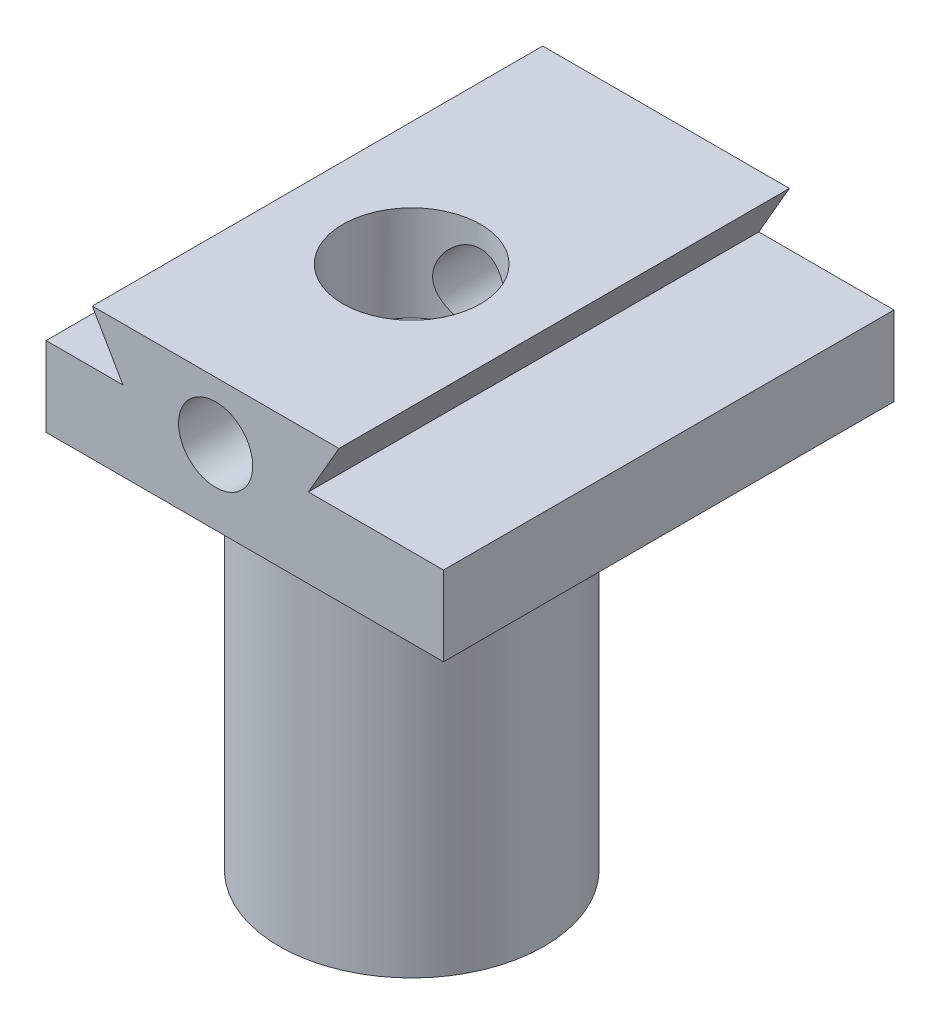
ISO-10303-21;
HEADER;
FILE_DESCRIPTION(('STEP AP214'),'2;1');
FILE_NAME('part.step','',(''),(''),'','','');
FILE_SCHEMA(('AUTOMOTIVE_DESIGN { 1 0 10303 214 1 1 1 1 }'));
ENDSEC;
DATA;
#1=APPLICATION_CONTEXT('core data for automotive mechanical design processes');
#2=APPLICATION_PROTOCOL_DEFINITION('international standard','automotive_design',2000,#1);
#3=PRODUCT_CONTEXT('',#1,'mechanical');
#4=PRODUCT('Part','Part','',(#3));
#5=PRODUCT_RELATED_PRODUCT_CATEGORY('part','',(#4));
#6=PRODUCT_DEFINITION_FORMATION('','',#4);
#7=PRODUCT_DEFINITION_CONTEXT('part definition',#1,'design');
#8=PRODUCT_DEFINITION('design','',#6,#7);
#9=PRODUCT_DEFINITION_SHAPE('','',#8);
#10=(LENGTH_UNIT() NAMED_UNIT(*) SI_UNIT(.MILLI.,.METRE.));
#11=(NAMED_UNIT(*) PLANE_ANGLE_UNIT() SI_UNIT($,.RADIAN.));
#12=(NAMED_UNIT(*) SI_UNIT($,.STERADIAN.) SOLID_ANGLE_UNIT());
#13=UNCERTAINTY_MEASURE_WITH_UNIT(LENGTH_MEASURE(1.E-05),#10,'distance_accuracy_value','');
#14=(GEOMETRIC_REPRESENTATION_CONTEXT(3) GLOBAL_UNCERTAINTY_ASSIGNED_CONTEXT((#13)) GLOBAL_UNIT_ASSIGNED_CONTEXT((#10,
#11,#12)) REPRESENTATION_CONTEXT('',''));
#15=CARTESIAN_POINT('',(0.,0.,0.));
#16=DIRECTION('',(0.,0.,1.));
#17=DIRECTION('',(1.,0.,0.));
#18=AXIS2_PLACEMENT_3D('',#15,#16,#17);
#19=CARTESIAN_POINT('',(-98.6043613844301,-52.9145728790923,48.));
#20=DIRECTION('',(0.,1.,0.));
#21=DIRECTION('',(-1.,0.,0.));
#22=AXIS2_PLACEMENT_3D('',#19,#20,#21);
#23=CYLINDRICAL_SURFACE('',#22,25.);
#24=CARTESIAN_POINT('',(-98.6043613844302,18.0854271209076,48.));
#25=DIRECTION('',(0.,-1.,0.));
#26=DIRECTION('',(1.,0.,0.));
#27=AXIS2_PLACEMENT_3D('',#24,#25,#26);
#28=CIRCLE('',#27,25.);
#29=CARTESIAN_POINT('',(-73.6043613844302,18.0854271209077,48.));
#30=VERTEX_POINT('',#29);
#31=EDGE_CURVE('E457',#30,#30,#28,.T.);
#32=ORIENTED_EDGE('',*,*,#31,.T.);
#33=EDGE_LOOP('',(#32));
#34=FACE_BOUND('',#33,.T.);
#35=CARTESIAN_POINT('',(-98.6043613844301,-52.9145728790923,48.));
#36=DIRECTION('',(0.,-1.,0.));
#37=DIRECTION('',(1.,0.,0.));
#38=AXIS2_PLACEMENT_3D('',#35,#36,#37);
#39=CIRCLE('',#38,25.);
#40=CARTESIAN_POINT('',(-73.6043613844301,-52.9145728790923,48.));
#41=VERTEX_POINT('',#40);
#42=EDGE_CURVE('E188',#41,#41,#39,.T.);
#43=ORIENTED_EDGE('',*,*,#42,.F.);
#44=EDGE_LOOP('',(#43));
#45=FACE_BOUND('',#44,.T.);
#46=DIRECTION('',(0.,1.,0.));
#47=VECTOR('',#46,1.);
#48=CARTESIAN_POINT('',(-122.60436138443,-52.9145728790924,55.));
#49=LINE('',#48,#47);
#50=CARTESIAN_POINT('',(-122.60436138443,9.08542712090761,55.));
#51=VERTEX_POINT('',#50);
#52=CARTESIAN_POINT('',(-122.60436138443,-32.9145728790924,55.));
#53=VERTEX_POINT('',#52);
#54=EDGE_CURVE('E12',#51,#53,#49,.F.);
#55=ORIENTED_EDGE('',*,*,#54,.T.);
#56=CARTESIAN_POINT('',(-122.60436138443,-32.9145728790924,41.));
#57=CARTESIAN_POINT('',(-122.604335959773,-33.1073068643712,40.9999745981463));
#58=CARTESIAN_POINT('',(-122.606682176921,-33.3000317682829,41.0079587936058));
#59=CARTESIAN_POINT('',(-122.61593249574,-33.6840233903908,41.0397588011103));
#60=CARTESIAN_POINT('',(-122.622835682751,-33.875290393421,41.0635714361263));
#61=CARTESIAN_POINT('',(-122.640993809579,-34.2545687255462,41.1267682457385));
#62=CARTESIAN_POINT('',(-122.652238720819,-34.442586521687,41.1661165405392));
#63=CARTESIAN_POINT('',(-122.678731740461,-34.8144919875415,41.2600381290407));
#64=CARTESIAN_POINT('',(-122.693979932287,-34.9983795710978,41.3146117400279));
#65=CARTESIAN_POINT('',(-122.728020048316,-35.3606778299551,41.438505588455));
#66=CARTESIAN_POINT('',(-122.746810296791,-35.5390910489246,41.5078188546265));
#67=CARTESIAN_POINT('',(-122.787402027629,-35.8894243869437,41.6606941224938));
#68=CARTESIAN_POINT('',(-122.809204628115,-36.0613420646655,41.7442614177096));
#69=CARTESIAN_POINT('',(-122.855200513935,-36.3975212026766,41.9250108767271));
#70=CARTESIAN_POINT('',(-122.879393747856,-36.5617828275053,42.0221927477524));
#71=CARTESIAN_POINT('',(-122.929515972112,-36.8817028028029,42.2295380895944));
#72=CARTESIAN_POINT('',(-122.955445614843,-37.0373578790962,42.3397064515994));
#73=CARTESIAN_POINT('',(-123.008982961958,-37.3427446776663,42.575116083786));
#74=CARTESIAN_POINT('',(-123.036616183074,-37.4922388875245,42.7006597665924));
#75=CARTESIAN_POINT('',(-123.092210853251,-37.7802432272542,42.9637996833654));
#76=CARTESIAN_POINT('',(-123.120172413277,-37.9187495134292,43.1014000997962));
#77=CARTESIAN_POINT('',(-123.175651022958,-38.1838305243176,43.3877351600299));
#78=CARTESIAN_POINT('',(-123.203168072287,-38.3104052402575,43.5364698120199));
#79=CARTESIAN_POINT('',(-123.257010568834,-38.5507804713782,43.8441279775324));
#80=CARTESIAN_POINT('',(-123.283336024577,-38.6645810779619,44.0030514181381));
#81=CARTESIAN_POINT('',(-123.334539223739,-38.88055172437,44.3330292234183));
#82=CARTESIAN_POINT('',(-123.359382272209,-38.9824748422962,44.5042507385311));
#83=CARTESIAN_POINT('',(-123.406380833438,-39.1714527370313,44.8549847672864));
#84=CARTESIAN_POINT('',(-123.428537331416,-39.2585129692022,45.0344942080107));
#85=CARTESIAN_POINT('',(-123.469544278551,-39.4171257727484,45.4006501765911));
#86=CARTESIAN_POINT('',(-123.488394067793,-39.488675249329,45.5872981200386));
#87=CARTESIAN_POINT('',(-123.522228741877,-39.6156069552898,45.9662704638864));
#88=CARTESIAN_POINT('',(-123.537215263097,-39.6709960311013,46.1585924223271));
#89=CARTESIAN_POINT('',(-123.562576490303,-39.7639854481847,46.5427322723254));
#90=CARTESIAN_POINT('',(-123.573056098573,-39.8019918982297,46.7344449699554));
#91=CARTESIAN_POINT('',(-123.58963244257,-39.8618456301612,47.1204900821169));
#92=CARTESIAN_POINT('',(-123.595730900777,-39.8836992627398,47.3148214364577));
#93=CARTESIAN_POINT('',(-123.603378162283,-39.9110729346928,47.7047306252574));
#94=CARTESIAN_POINT('',(-123.604926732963,-39.9165921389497,47.9003085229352));
#95=CARTESIAN_POINT('',(-123.60342919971,-39.9112434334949,48.2912208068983));
#96=CARTESIAN_POINT('',(-123.600383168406,-39.9003757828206,48.4865551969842));
#97=CARTESIAN_POINT('',(-123.589932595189,-39.8628877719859,48.8700549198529));
#98=CARTESIAN_POINT('',(-123.582652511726,-39.8367171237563,49.058267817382));
#99=CARTESIAN_POINT('',(-123.564026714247,-39.7692023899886,49.4318134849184));
#100=CARTESIAN_POINT('',(-123.552679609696,-39.727853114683,49.6171452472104));
#101=CARTESIAN_POINT('',(-123.526226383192,-39.6303419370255,49.9835248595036));
#102=CARTESIAN_POINT('',(-123.511121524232,-39.5741850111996,50.1645741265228));
#103=CARTESIAN_POINT('',(-123.477541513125,-39.4474757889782,50.5213139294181));
#104=CARTESIAN_POINT('',(-123.459065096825,-39.3769180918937,50.6970024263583));
#105=CARTESIAN_POINT('',(-123.419020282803,-39.2211580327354,51.0435917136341));
#106=CARTESIAN_POINT('',(-123.397422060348,-39.1358126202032,51.214424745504));
#107=CARTESIAN_POINT('',(-123.351836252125,-38.9515818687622,51.5483659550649));
#108=CARTESIAN_POINT('',(-123.327847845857,-38.8526918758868,51.7114714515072));
#109=CARTESIAN_POINT('',(-123.278110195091,-38.6420808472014,52.0288869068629));
#110=CARTESIAN_POINT('',(-123.252360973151,-38.530359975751,52.1831969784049));
#111=CARTESIAN_POINT('',(-123.199765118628,-38.2948201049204,52.482091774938));
#112=CARTESIAN_POINT('',(-123.172918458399,-38.1710008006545,52.6266762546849));
#113=CARTESIAN_POINT('',(-123.117903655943,-37.9076568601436,52.9099660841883));
#114=CARTESIAN_POINT('',(-123.089721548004,-37.7677424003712,53.0483066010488));
#115=CARTESIAN_POINT('',(-123.03371576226,-37.4767790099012,53.3127117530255));
#116=CARTESIAN_POINT('',(-123.005891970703,-37.3257337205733,53.4387803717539));
#117=CARTESIAN_POINT('',(-122.951356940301,-37.0133357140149,53.6779277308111));
#118=CARTESIAN_POINT('',(-122.924646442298,-36.8519763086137,53.790997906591));
#119=CARTESIAN_POINT('',(-122.873133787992,-36.5201466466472,54.0032165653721));
#120=CARTESIAN_POINT('',(-122.848330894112,-36.3496799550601,54.1023704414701));
#121=CARTESIAN_POINT('',(-122.801153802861,-35.9992371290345,54.2868419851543));
#122=CARTESIAN_POINT('',(-122.7788016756,-35.8191933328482,54.3720368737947));
#123=CARTESIAN_POINT('',(-122.73746195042,-35.4522408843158,54.5268582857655));
#124=CARTESIAN_POINT('',(-122.718472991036,-35.2653350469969,54.5964911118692));
#125=CARTESIAN_POINT('',(-122.684465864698,-34.8861323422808,54.7195719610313));
#126=CARTESIAN_POINT('',(-122.669443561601,-34.6938413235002,54.7730368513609));
#127=CARTESIAN_POINT('',(-122.643833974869,-34.3051923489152,54.8633780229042));
#128=CARTESIAN_POINT('',(-122.633244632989,-34.1088363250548,54.9002620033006));
#129=CARTESIAN_POINT('',(-122.618199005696,-33.7461681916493,54.9524267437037));
#130=CARTESIAN_POINT('',(-122.613018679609,-33.5802496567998,54.9702692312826));
#131=CARTESIAN_POINT('',(-122.60609576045,-33.2477494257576,54.9940528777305));
#132=CARTESIAN_POINT('',(-122.604347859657,-33.0811691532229,55.0000124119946));
#133=CARTESIAN_POINT('',(-122.60436138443,-32.9145728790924,55.));
#134=B_SPLINE_CURVE_WITH_KNOTS('',3,(#56,#57,#58,#59,#60,#61,#62,#63,#64,#65,#66,#67,#68,#69,
#70,#71,#72,#73,#74,#75,#76,#77,#78,#79,#80,#81,#82,#83,#84,#85,#86,#87,#88,#89,#90,#91,#92,#93,
#94,#95,#96,#97,#98,#99,#100,#101,#102,#103,#104,#105,#106,#107,#108,#109,#110,#111,#112,#113,
#114,#115,#116,#117,#118,#119,#120,#121,#122,#123,#124,#125,#126,#127,#128,#129,#130,#131,#132,
#133),.UNSPECIFIED.,.F.,.F.,(4,2,2,2,2,2,2,2,2,2,2,2,2,2,2,2,2,2,2,2,2,2,2,2,2,2,2,2,2,2,2,2,2,
2,2,2,2,2,4),(0.,0.578008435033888,1.15590088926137,1.73246642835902,2.30904398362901,
2.88534944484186,3.4618693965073,4.03837695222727,4.61510233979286,5.20591312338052,
5.7969296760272,6.3879466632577,6.97895942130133,7.58063671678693,8.18209269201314,
8.78366856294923,9.38498920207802,9.97143647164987,10.5576530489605,11.1438995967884,
11.7301368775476,12.2999553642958,12.8699688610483,13.4397910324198,14.0098272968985,
14.5857217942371,15.1618146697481,15.7379001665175,16.3140001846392,16.9096069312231,
17.5050196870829,18.1008225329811,18.6963938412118,19.2969509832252,19.8972644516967,
20.4969494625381,21.0963557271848,21.5967733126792,22.0964164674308),.UNSPECIFIED.);
#135=CARTESIAN_POINT('',(-122.60436138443,-32.9145728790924,41.));
#136=VERTEX_POINT('',#135);
#137=EDGE_CURVE('E56',#136,#53,#134,.T.);
#138=ORIENTED_EDGE('',*,*,#137,.F.);
#139=DIRECTION('',(0.,1.,0.));
#140=VECTOR('',#139,1.);
#141=CARTESIAN_POINT('',(-122.60436138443,-52.9145728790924,41.));
#142=LINE('',#141,#140);
#143=CARTESIAN_POINT('',(-122.60436138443,9.08542712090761,41.));
#144=VERTEX_POINT('',#143);
#145=EDGE_CURVE('E70',#136,#144,#142,.T.);
#146=ORIENTED_EDGE('',*,*,#145,.T.);
#147=CARTESIAN_POINT('',(-122.60436138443,9.08542712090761,55.));
#148=CARTESIAN_POINT('',(-122.604335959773,9.27816110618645,55.0000254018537));
#149=CARTESIAN_POINT('',(-122.606682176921,9.47088601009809,54.9920412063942));
#150=CARTESIAN_POINT('',(-122.61593249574,9.85487763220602,54.9602411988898));
#151=CARTESIAN_POINT('',(-122.622835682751,10.0461446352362,54.9364285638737));
#152=CARTESIAN_POINT('',(-122.640993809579,10.4254229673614,54.8732317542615));
#153=CARTESIAN_POINT('',(-122.65223872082,10.6134407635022,54.8338834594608));
#154=CARTESIAN_POINT('',(-122.678731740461,10.9853462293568,54.7399618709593));
#155=CARTESIAN_POINT('',(-122.693979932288,11.1692338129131,54.6853882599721));
#156=CARTESIAN_POINT('',(-122.728020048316,11.5315320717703,54.561494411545));
#157=CARTESIAN_POINT('',(-122.746810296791,11.7099452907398,54.4921811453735));
#158=CARTESIAN_POINT('',(-122.787402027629,12.0602786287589,54.3393058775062));
#159=CARTESIAN_POINT('',(-122.809204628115,12.2321963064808,54.2557385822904));
#160=CARTESIAN_POINT('',(-122.855200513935,12.5683754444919,54.0749891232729));
#161=CARTESIAN_POINT('',(-122.879393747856,12.7326370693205,53.9778072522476));
#162=CARTESIAN_POINT('',(-122.929515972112,13.0525570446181,53.7704619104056));
#163=CARTESIAN_POINT('',(-122.955445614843,13.2082121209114,53.6602935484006));
#164=CARTESIAN_POINT('',(-123.008982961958,13.5135989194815,53.424883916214));
#165=CARTESIAN_POINT('',(-123.036616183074,13.6630931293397,53.2993402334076));
#166=CARTESIAN_POINT('',(-123.092210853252,13.9510974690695,53.0362003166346));
#167=CARTESIAN_POINT('',(-123.120172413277,14.0896037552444,52.8985999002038));
#168=CARTESIAN_POINT('',(-123.175651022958,14.3546847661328,52.6122648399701));
#169=CARTESIAN_POINT('',(-123.203168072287,14.4812594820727,52.4635301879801));
#170=CARTESIAN_POINT('',(-123.257010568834,14.7216347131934,52.1558720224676));
#171=CARTESIAN_POINT('',(-123.283336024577,14.8354353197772,51.996948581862));
#172=CARTESIAN_POINT('',(-123.334539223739,15.0514059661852,51.6669707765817));
#173=CARTESIAN_POINT('',(-123.359382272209,15.1533290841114,51.4957492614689));
#174=CARTESIAN_POINT('',(-123.406380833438,15.3423069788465,51.1450152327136));
#175=CARTESIAN_POINT('',(-123.428537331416,15.4293672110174,50.9655057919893));
#176=CARTESIAN_POINT('',(-123.469544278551,15.5879800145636,50.5993498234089));
#177=CARTESIAN_POINT('',(-123.488394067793,15.6595294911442,50.4127018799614));
#178=CARTESIAN_POINT('',(-123.522228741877,15.786461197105,50.0337295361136));
#179=CARTESIAN_POINT('',(-123.537215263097,15.8418502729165,49.8414075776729));
#180=CARTESIAN_POINT('',(-123.562576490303,15.93483969,49.4572677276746));
#181=CARTESIAN_POINT('',(-123.573056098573,15.9728461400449,49.2655550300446));
#182=CARTESIAN_POINT('',(-123.58963244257,16.0326998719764,48.8795099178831));
#183=CARTESIAN_POINT('',(-123.595730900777,16.0545535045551,48.6851785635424));
#184=CARTESIAN_POINT('',(-123.603378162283,16.081927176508,48.2952693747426));
#185=CARTESIAN_POINT('',(-123.604926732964,16.0874463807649,48.0996914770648));
#186=CARTESIAN_POINT('',(-123.60342919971,16.0820976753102,47.7087791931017));
#187=CARTESIAN_POINT('',(-123.600383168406,16.0712300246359,47.5134448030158));
#188=CARTESIAN_POINT('',(-123.589932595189,16.0337420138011,47.1299450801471));
#189=CARTESIAN_POINT('',(-123.582652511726,16.0075713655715,46.941732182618));
#190=CARTESIAN_POINT('',(-123.564026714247,15.9400566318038,46.5681865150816));
#191=CARTESIAN_POINT('',(-123.552679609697,15.8987073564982,46.3828547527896));
#192=CARTESIAN_POINT('',(-123.526226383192,15.8011961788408,46.0164751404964));
#193=CARTESIAN_POINT('',(-123.511121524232,15.7450392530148,45.8354258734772));
#194=CARTESIAN_POINT('',(-123.477541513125,15.6183300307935,45.4786860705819));
#195=CARTESIAN_POINT('',(-123.459065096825,15.5477723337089,45.3029975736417));
#196=CARTESIAN_POINT('',(-123.419020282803,15.3920122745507,44.9564082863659));
#197=CARTESIAN_POINT('',(-123.397422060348,15.3066668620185,44.785575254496));
#198=CARTESIAN_POINT('',(-123.351836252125,15.1224361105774,44.4516340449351));
#199=CARTESIAN_POINT('',(-123.327847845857,15.023546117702,44.2885285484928));
#200=CARTESIAN_POINT('',(-123.278110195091,14.8129350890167,43.9711130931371));
#201=CARTESIAN_POINT('',(-123.252360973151,14.7012142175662,43.8168030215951));
#202=CARTESIAN_POINT('',(-123.199765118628,14.4656743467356,43.517908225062));
#203=CARTESIAN_POINT('',(-123.172918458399,14.3418550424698,43.3733237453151));
#204=CARTESIAN_POINT('',(-123.117903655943,14.0785111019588,43.0900339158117));
#205=CARTESIAN_POINT('',(-123.089721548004,13.9385966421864,42.9516933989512));
#206=CARTESIAN_POINT('',(-123.03371576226,13.6476332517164,42.6872882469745));
#207=CARTESIAN_POINT('',(-123.005891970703,13.4965879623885,42.5612196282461));
#208=CARTESIAN_POINT('',(-122.951356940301,13.1841899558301,42.3220722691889));
#209=CARTESIAN_POINT('',(-122.924646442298,13.0228305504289,42.209002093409));
#210=CARTESIAN_POINT('',(-122.873133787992,12.6910008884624,41.9967834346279));
#211=CARTESIAN_POINT('',(-122.848330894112,12.5205341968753,41.8976295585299));
#212=CARTESIAN_POINT('',(-122.801153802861,12.1700913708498,41.7131580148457));
#213=CARTESIAN_POINT('',(-122.7788016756,11.9900475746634,41.6279631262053));
#214=CARTESIAN_POINT('',(-122.73746195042,11.623095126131,41.4731417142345));
#215=CARTESIAN_POINT('',(-122.718472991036,11.4361892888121,41.4035088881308));
#216=CARTESIAN_POINT('',(-122.684465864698,11.056986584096,41.2804280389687));
#217=CARTESIAN_POINT('',(-122.669443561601,10.8646955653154,41.2269631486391));
#218=CARTESIAN_POINT('',(-122.643833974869,10.4760465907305,41.1366219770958));
#219=CARTESIAN_POINT('',(-122.633244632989,10.2796905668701,41.0997379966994));
#220=CARTESIAN_POINT('',(-122.618199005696,9.91702243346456,41.0475732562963));
#221=CARTESIAN_POINT('',(-122.613018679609,9.75110389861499,41.0297307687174));
#222=CARTESIAN_POINT('',(-122.60609576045,9.41860366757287,41.0059471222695));
#223=CARTESIAN_POINT('',(-122.604347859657,9.25202339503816,40.9999875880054));
#224=CARTESIAN_POINT('',(-122.60436138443,9.08542712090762,41.));
#225=B_SPLINE_CURVE_WITH_KNOTS('',3,(#147,#148,#149,#150,#151,#152,#153,#154,#155,#156,#157,
#158,#159,#160,#161,#162,#163,#164,#165,#166,#167,#168,#169,#170,#171,#172,#173,#174,#175,#176,
#177,#178,#179,#180,#181,#182,#183,#184,#185,#186,#187,#188,#189,#190,#191,#192,#193,#194,#195,
#196,#197,#198,#199,#200,#201,#202,#203,#204,#205,#206,#207,#208,#209,#210,#211,#212,#213,#214,
#215,#216,#217,#218,#219,#220,#221,#222,#223,#224),.UNSPECIFIED.,.F.,.F.,(4,2,2,2,2,2,2,2,2,2,2,
2,2,2,2,2,2,2,2,2,2,2,2,2,2,2,2,2,2,2,2,2,2,2,2,2,2,2,4),(0.,0.578008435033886,1.15590088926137,
1.73246642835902,2.30904398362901,2.88534944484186,3.46186939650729,4.03837695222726,
4.61510233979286,5.20591312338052,5.79692967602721,6.3879466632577,6.97895942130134,
7.58063671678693,8.18209269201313,8.78366856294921,9.38498920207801,9.97143647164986,
10.5576530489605,11.1438995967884,11.7301368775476,12.2999553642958,12.8699688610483,
13.4397910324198,14.0098272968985,14.5857217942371,15.1618146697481,15.7379001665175,
16.3140001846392,16.9096069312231,17.505019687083,18.1008225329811,18.6963938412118,
19.2969509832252,19.8972644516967,20.4969494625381,21.0963557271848,21.5967733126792,
22.0964164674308),.UNSPECIFIED.);
#226=EDGE_CURVE('E181',#51,#144,#225,.T.);
#227=ORIENTED_EDGE('',*,*,#226,.F.);
#228=EDGE_LOOP('',(#55,#138,#146,#227));
#229=FACE_BOUND('',#228,.T.);
#230=ADVANCED_FACE('F47',(#34,#45,#229),#23,.T.);
#231=CARTESIAN_POINT('',(-106.60436138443,-24.9145728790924,48.));
#232=DIRECTION('',(-1.,0.,0.));
#233=DIRECTION('',(0.,-1.,0.));
#234=AXIS2_PLACEMENT_3D('',#231,#232,#233);
#235=CYLINDRICAL_SURFACE('',#234,3.);
#236=CARTESIAN_POINT('',(-108.60436138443,-27.9145728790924,48.));
#237=CARTESIAN_POINT('',(-108.604359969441,-27.9145708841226,48.1645772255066));
#238=CARTESIAN_POINT('',(-108.600259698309,-27.9009851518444,48.3291746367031));
#239=CARTESIAN_POINT('',(-108.584303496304,-27.8471301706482,48.6535762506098));
#240=CARTESIAN_POINT('',(-108.572445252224,-27.8068529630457,48.8133790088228));
#241=CARTESIAN_POINT('',(-108.542272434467,-27.7010808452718,49.1234654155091));
#242=CARTESIAN_POINT('',(-108.523967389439,-27.6356231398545,49.2737627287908));
#243=CARTESIAN_POINT('',(-108.482803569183,-27.4815006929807,49.5612483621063));
#244=CARTESIAN_POINT('',(-108.459944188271,-27.3928328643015,49.6984349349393));
#245=CARTESIAN_POINT('',(-108.411376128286,-27.192124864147,49.9597435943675));
#246=CARTESIAN_POINT('',(-108.385609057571,-27.0795396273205,50.0834361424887));
#247=CARTESIAN_POINT('',(-108.334478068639,-26.835354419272,50.3104984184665));
#248=CARTESIAN_POINT('',(-108.30911421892,-26.7037512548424,50.4138647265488));
#249=CARTESIAN_POINT('',(-108.261043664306,-26.4216313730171,50.5996007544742));
#250=CARTESIAN_POINT('',(-108.238409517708,-26.2707559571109,50.6814461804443));
#251=CARTESIAN_POINT('',(-108.199233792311,-25.9565943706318,50.8184278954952));
#252=CARTESIAN_POINT('',(-108.182690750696,-25.7933111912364,50.8735705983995));
#253=CARTESIAN_POINT('',(-108.158178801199,-25.4637923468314,50.954032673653));
#254=CARTESIAN_POINT('',(-108.149982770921,-25.2977673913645,50.9801439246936));
#255=CARTESIAN_POINT('',(-108.142417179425,-24.9635065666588,51.0042746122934));
#256=CARTESIAN_POINT('',(-108.143045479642,-24.7952712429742,51.0023008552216));
#257=CARTESIAN_POINT('',(-108.152856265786,-24.4678050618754,50.9709395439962));
#258=CARTESIAN_POINT('',(-108.161729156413,-24.3084683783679,50.9425441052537));
#259=CARTESIAN_POINT('',(-108.186528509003,-23.9969333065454,50.8607484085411));
#260=CARTESIAN_POINT('',(-108.202455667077,-23.8447356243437,50.8073456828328));
#261=CARTESIAN_POINT('',(-108.23981604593,-23.5493721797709,50.6763205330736));
#262=CARTESIAN_POINT('',(-108.261321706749,-23.4063587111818,50.5983763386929));
#263=CARTESIAN_POINT('',(-108.307381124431,-23.135108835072,50.4207044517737));
#264=CARTESIAN_POINT('',(-108.33193561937,-23.0068760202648,50.3209714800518));
#265=CARTESIAN_POINT('',(-108.382581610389,-22.7632004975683,50.0976258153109));
#266=CARTESIAN_POINT('',(-108.40869447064,-22.648515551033,49.9731898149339));
#267=CARTESIAN_POINT('',(-108.458606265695,-22.4414649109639,49.7065265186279));
#268=CARTESIAN_POINT('',(-108.482405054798,-22.3491006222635,49.5642981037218));
#269=CARTESIAN_POINT('',(-108.52522458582,-22.1888530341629,49.2647100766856));
#270=CARTESIAN_POINT('',(-108.544212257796,-22.1211378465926,49.1072554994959));
#271=CARTESIAN_POINT('',(-108.575031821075,-22.0133736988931,48.782490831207));
#272=CARTESIAN_POINT('',(-108.58686570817,-21.9733170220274,48.6151835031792));
#273=CARTESIAN_POINT('',(-108.601728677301,-21.9232685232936,48.2819044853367));
#274=CARTESIAN_POINT('',(-108.605058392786,-21.9122497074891,48.1161001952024));
#275=CARTESIAN_POINT('',(-108.603419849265,-21.9177111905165,47.7850007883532));
#276=CARTESIAN_POINT('',(-108.598452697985,-21.9341878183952,47.6197056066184));
#277=CARTESIAN_POINT('',(-108.580975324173,-21.9933421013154,47.2981927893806));
#278=CARTESIAN_POINT('',(-108.568637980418,-22.0354196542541,47.1418544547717));
#279=CARTESIAN_POINT('',(-108.537848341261,-22.1438593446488,46.838490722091));
#280=CARTESIAN_POINT('',(-108.519395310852,-22.2102244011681,46.6914664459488));
#281=CARTESIAN_POINT('',(-108.477754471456,-22.3670792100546,46.4071256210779));
#282=CARTESIAN_POINT('',(-108.454467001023,-22.4580915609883,46.2701123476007));
#283=CARTESIAN_POINT('',(-108.405830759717,-22.661022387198,46.0129533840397));
#284=CARTESIAN_POINT('',(-108.380481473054,-22.7729461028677,45.8928119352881));
#285=CARTESIAN_POINT('',(-108.32942482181,-23.0193474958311,45.6682851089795));
#286=CARTESIAN_POINT('',(-108.303737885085,-23.154496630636,45.56463037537));
#287=CARTESIAN_POINT('',(-108.25589168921,-23.4408287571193,45.3814200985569));
#288=CARTESIAN_POINT('',(-108.233732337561,-23.5920113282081,45.3018639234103));
#289=CARTESIAN_POINT('',(-108.195705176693,-23.9056378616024,45.1696530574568));
#290=CARTESIAN_POINT('',(-108.179808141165,-24.068025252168,45.1168730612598));
#291=CARTESIAN_POINT('',(-108.156193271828,-24.3999488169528,45.0395653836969));
#292=CARTESIAN_POINT('',(-108.148472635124,-24.5694825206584,45.0150280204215));
#293=CARTESIAN_POINT('',(-108.142360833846,-24.9032959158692,44.9955603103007));
#294=CARTESIAN_POINT('',(-108.143594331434,-25.0675001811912,44.9994388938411));
#295=CARTESIAN_POINT('',(-108.154349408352,-25.3928010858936,45.0338498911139));
#296=CARTESIAN_POINT('',(-108.163870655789,-25.5538978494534,45.0643812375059));
#297=CARTESIAN_POINT('',(-108.189876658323,-25.8664636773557,45.1504622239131));
#298=CARTESIAN_POINT('',(-108.206273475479,-26.0180274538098,45.2056964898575));
#299=CARTESIAN_POINT('',(-108.244166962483,-26.3098577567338,45.3393698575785));
#300=CARTESIAN_POINT('',(-108.265664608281,-26.4501221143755,45.4178134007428));
#301=CARTESIAN_POINT('',(-108.312314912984,-26.7208991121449,45.5990247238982));
#302=CARTESIAN_POINT('',(-108.337572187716,-26.8508704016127,45.70257447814));
#303=CARTESIAN_POINT('',(-108.388387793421,-27.0919778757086,45.9296513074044));
#304=CARTESIAN_POINT('',(-108.413946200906,-27.203109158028,46.053183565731));
#305=CARTESIAN_POINT('',(-108.463380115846,-27.4066197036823,46.3210684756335));
#306=CARTESIAN_POINT('',(-108.487184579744,-27.4983557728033,46.4659242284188));
#307=CARTESIAN_POINT('',(-108.529574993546,-27.6560432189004,46.7697172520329));
#308=CARTESIAN_POINT('',(-108.548163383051,-27.7220066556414,46.9286478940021));
#309=CARTESIAN_POINT('',(-108.576404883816,-27.8203634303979,47.2384845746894));
#310=CARTESIAN_POINT('',(-108.586801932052,-27.8555962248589,47.3884260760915));
#311=CARTESIAN_POINT('',(-108.60078027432,-27.9026999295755,47.6922396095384));
#312=CARTESIAN_POINT('',(-108.604362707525,-27.914574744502,47.8461109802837));
#313=CARTESIAN_POINT('',(-108.60436138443,-27.9145728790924,48.));
#314=B_SPLINE_CURVE_WITH_KNOTS('',3,(#236,#237,#238,#239,#240,#241,#242,#243,#244,#245,#246,
#247,#248,#249,#250,#251,#252,#253,#254,#255,#256,#257,#258,#259,#260,#261,#262,#263,#264,#265,
#266,#267,#268,#269,#270,#271,#272,#273,#274,#275,#276,#277,#278,#279,#280,#281,#282,#283,#284,
#285,#286,#287,#288,#289,#290,#291,#292,#293,#294,#295,#296,#297,#298,#299,#300,#301,#302,#303,
#304,#305,#306,#307,#308,#309,#310,#311,#312,#313),.UNSPECIFIED.,.T.,.F.,(4,2,2,2,2,2,2,2,2,2,2,
2,2,2,2,2,2,2,2,2,2,2,2,2,2,2,2,2,2,2,2,2,2,2,2,2,2,2,4),(0.,0.493166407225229,
0.986479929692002,1.47906735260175,1.97172032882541,2.47711205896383,2.98258874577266,
3.49942962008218,4.01614629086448,4.51839378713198,5.02051956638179,5.50452033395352,
5.98856887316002,6.47924852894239,6.97004720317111,7.48134208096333,7.99266913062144,
8.50742093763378,9.02202907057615,9.5181761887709,10.0142570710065,10.4991349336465,
10.9840710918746,11.4802261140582,11.9765056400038,12.4908080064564,13.0050968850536,
13.516956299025,14.0286401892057,14.5190031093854,15.0093463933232,15.4936008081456,
15.9779479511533,16.4799385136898,16.9820594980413,17.4988599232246,18.0154182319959,
18.4766338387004,18.9377723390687),.UNSPECIFIED.);
#315=CARTESIAN_POINT('',(-108.60436138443,-27.9145728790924,48.));
#316=VERTEX_POINT('',#315);
#317=EDGE_CURVE('E124',#316,#316,#314,.T.);
#318=ORIENTED_EDGE('',*,*,#317,.F.);
#319=EDGE_LOOP('',(#318));
#320=FACE_BOUND('',#319,.T.);
#321=CARTESIAN_POINT('',(-117.60436138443,-24.9145728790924,48.));
#322=DIRECTION('',(-1.,0.,0.));
#323=DIRECTION('',(0.,-1.,0.));
#324=AXIS2_PLACEMENT_3D('',#321,#322,#323);
#325=CIRCLE('',#324,3.);
#326=CARTESIAN_POINT('',(-117.60436138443,-27.9145728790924,48.));
#327=VERTEX_POINT('',#326);
#328=EDGE_CURVE('E95',#327,#327,#325,.T.);
#329=ORIENTED_EDGE('',*,*,#328,.T.);
#330=EDGE_LOOP('',(#329));
#331=FACE_BOUND('',#330,.T.);
#332=ADVANCED_FACE('F140',(#320,#331),#235,.F.);
#333=CARTESIAN_POINT('',(-106.60436138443,1.08542712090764,48.));
#334=DIRECTION('',(-1.,0.,0.));
#335=DIRECTION('',(0.,-1.,0.));
#336=AXIS2_PLACEMENT_3D('',#333,#334,#335);
#337=CYLINDRICAL_SURFACE('',#336,3.);
#338=CARTESIAN_POINT('',(-108.60436138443,-1.91457287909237,48.));
#339=CARTESIAN_POINT('',(-108.604359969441,-1.9145708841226,48.1645772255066));
#340=CARTESIAN_POINT('',(-108.600259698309,-1.90098515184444,48.3291746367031));
#341=CARTESIAN_POINT('',(-108.584303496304,-1.84713017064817,48.6535762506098));
#342=CARTESIAN_POINT('',(-108.572445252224,-1.80685296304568,48.8133790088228));
#343=CARTESIAN_POINT('',(-108.542272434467,-1.70108084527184,49.1234654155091));
#344=CARTESIAN_POINT('',(-108.523967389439,-1.6356231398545,49.2737627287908));
#345=CARTESIAN_POINT('',(-108.482803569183,-1.4815006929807,49.5612483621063));
#346=CARTESIAN_POINT('',(-108.459944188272,-1.39283286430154,49.6984349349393));
#347=CARTESIAN_POINT('',(-108.411376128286,-1.19212486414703,49.9597435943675));
#348=CARTESIAN_POINT('',(-108.385609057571,-1.07953962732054,50.0834361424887));
#349=CARTESIAN_POINT('',(-108.334478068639,-0.835354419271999,50.3104984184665));
#350=CARTESIAN_POINT('',(-108.30911421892,-0.703751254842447,50.4138647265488));
#351=CARTESIAN_POINT('',(-108.261043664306,-0.421631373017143,50.5996007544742));
#352=CARTESIAN_POINT('',(-108.238409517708,-0.270755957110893,50.6814461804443));
#353=CARTESIAN_POINT('',(-108.199233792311,0.0434056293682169,50.8184278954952));
#354=CARTESIAN_POINT('',(-108.182690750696,0.206688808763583,50.8735705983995));
#355=CARTESIAN_POINT('',(-108.158178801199,0.536207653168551,50.954032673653));
#356=CARTESIAN_POINT('',(-108.149982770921,0.702232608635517,50.9801439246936));
#357=CARTESIAN_POINT('',(-108.142417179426,1.03649343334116,51.0042746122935));
#358=CARTESIAN_POINT('',(-108.143045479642,1.2047287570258,51.0023008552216));
#359=CARTESIAN_POINT('',(-108.152856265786,1.5321949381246,50.9709395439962));
#360=CARTESIAN_POINT('',(-108.161729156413,1.69153162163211,50.9425441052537));
#361=CARTESIAN_POINT('',(-108.186528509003,2.00306669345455,50.8607484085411));
#362=CARTESIAN_POINT('',(-108.202455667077,2.15526437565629,50.8073456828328));
#363=CARTESIAN_POINT('',(-108.23981604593,2.45062782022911,50.6763205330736));
#364=CARTESIAN_POINT('',(-108.261321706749,2.59364128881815,50.5983763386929));
#365=CARTESIAN_POINT('',(-108.307381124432,2.86489116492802,50.4207044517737));
#366=CARTESIAN_POINT('',(-108.33193561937,2.99312397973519,50.3209714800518));
#367=CARTESIAN_POINT('',(-108.382581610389,3.23679950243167,50.0976258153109));
#368=CARTESIAN_POINT('',(-108.40869447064,3.35148444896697,49.973189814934));
#369=CARTESIAN_POINT('',(-108.458606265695,3.55853508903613,49.7065265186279));
#370=CARTESIAN_POINT('',(-108.482405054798,3.65089937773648,49.5642981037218));
#371=CARTESIAN_POINT('',(-108.52522458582,3.81114696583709,49.2647100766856));
#372=CARTESIAN_POINT('',(-108.544212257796,3.87886215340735,49.1072554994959));
#373=CARTESIAN_POINT('',(-108.575031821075,3.98662630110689,48.7824908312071));
#374=CARTESIAN_POINT('',(-108.58686570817,4.02668297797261,48.6151835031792));
#375=CARTESIAN_POINT('',(-108.601728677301,4.07673147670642,48.2819044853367));
#376=CARTESIAN_POINT('',(-108.605058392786,4.08775029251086,48.1161001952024));
#377=CARTESIAN_POINT('',(-108.603419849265,4.08228880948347,47.7850007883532));
#378=CARTESIAN_POINT('',(-108.598452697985,4.06581218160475,47.6197056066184));
#379=CARTESIAN_POINT('',(-108.580975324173,4.00665789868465,47.2981927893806));
#380=CARTESIAN_POINT('',(-108.568637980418,3.9645803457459,47.1418544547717));
#381=CARTESIAN_POINT('',(-108.537848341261,3.85614065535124,46.838490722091));
#382=CARTESIAN_POINT('',(-108.519395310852,3.78977559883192,46.6914664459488));
#383=CARTESIAN_POINT('',(-108.477754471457,3.63292078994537,46.4071256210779));
#384=CARTESIAN_POINT('',(-108.454467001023,3.54190843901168,46.2701123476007));
#385=CARTESIAN_POINT('',(-108.405830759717,3.33897761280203,46.0129533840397));
#386=CARTESIAN_POINT('',(-108.380481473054,3.22705389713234,45.8928119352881));
#387=CARTESIAN_POINT('',(-108.32942482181,2.9806525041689,45.6682851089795));
#388=CARTESIAN_POINT('',(-108.303737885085,2.84550336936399,45.56463037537));
#389=CARTESIAN_POINT('',(-108.25589168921,2.55917124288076,45.3814200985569));
#390=CARTESIAN_POINT('',(-108.233732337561,2.40798867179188,45.3018639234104));
#391=CARTESIAN_POINT('',(-108.195705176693,2.0943621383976,45.1696530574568));
#392=CARTESIAN_POINT('',(-108.179808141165,1.93197474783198,45.1168730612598));
#393=CARTESIAN_POINT('',(-108.156193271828,1.60005118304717,45.0395653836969));
#394=CARTESIAN_POINT('',(-108.148472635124,1.43051747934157,45.0150280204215));
#395=CARTESIAN_POINT('',(-108.142360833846,1.0967040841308,44.9955603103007));
#396=CARTESIAN_POINT('',(-108.143594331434,0.932499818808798,44.9994388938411));
#397=CARTESIAN_POINT('',(-108.154349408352,0.607198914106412,45.0338498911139));
#398=CARTESIAN_POINT('',(-108.163870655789,0.446102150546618,45.0643812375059));
#399=CARTESIAN_POINT('',(-108.189876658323,0.133536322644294,45.1504622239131));
#400=CARTESIAN_POINT('',(-108.20627347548,-0.0180274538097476,45.2056964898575));
#401=CARTESIAN_POINT('',(-108.244166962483,-0.309857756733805,45.3393698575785));
#402=CARTESIAN_POINT('',(-108.265664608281,-0.450122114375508,45.4178134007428));
#403=CARTESIAN_POINT('',(-108.312314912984,-0.720899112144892,45.5990247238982));
#404=CARTESIAN_POINT('',(-108.337572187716,-0.850870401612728,45.70257447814));
#405=CARTESIAN_POINT('',(-108.388387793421,-1.09197787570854,45.9296513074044));
#406=CARTESIAN_POINT('',(-108.413946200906,-1.203109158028,46.053183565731));
#407=CARTESIAN_POINT('',(-108.463380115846,-1.4066197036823,46.3210684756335));
#408=CARTESIAN_POINT('',(-108.487184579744,-1.49835577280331,46.4659242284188));
#409=CARTESIAN_POINT('',(-108.529574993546,-1.65604321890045,46.7697172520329));
#410=CARTESIAN_POINT('',(-108.548163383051,-1.72200665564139,46.9286478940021));
#411=CARTESIAN_POINT('',(-108.576404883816,-1.82036343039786,47.2384845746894));
#412=CARTESIAN_POINT('',(-108.586801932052,-1.85559622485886,47.3884260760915));
#413=CARTESIAN_POINT('',(-108.60078027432,-1.90269992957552,47.6922396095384));
#414=CARTESIAN_POINT('',(-108.604362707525,-1.91457474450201,47.8461109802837));
#415=CARTESIAN_POINT('',(-108.60436138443,-1.91457287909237,48.));
#416=B_SPLINE_CURVE_WITH_KNOTS('',3,(#338,#339,#340,#341,#342,#343,#344,#345,#346,#347,#348,
#349,#350,#351,#352,#353,#354,#355,#356,#357,#358,#359,#360,#361,#362,#363,#364,#365,#366,#367,
#368,#369,#370,#371,#372,#373,#374,#375,#376,#377,#378,#379,#380,#381,#382,#383,#384,#385,#386,
#387,#388,#389,#390,#391,#392,#393,#394,#395,#396,#397,#398,#399,#400,#401,#402,#403,#404,#405,
#406,#407,#408,#409,#410,#411,#412,#413,#414,#415),.UNSPECIFIED.,.T.,.F.,(4,2,2,2,2,2,2,2,2,2,2,
2,2,2,2,2,2,2,2,2,2,2,2,2,2,2,2,2,2,2,2,2,2,2,2,2,2,2,4),(0.,0.493166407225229,
0.986479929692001,1.47906735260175,1.97172032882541,2.47711205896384,2.98258874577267,
3.49942962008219,4.01614629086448,4.51839378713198,5.02051956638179,5.50452033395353,
5.98856887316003,6.47924852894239,6.97004720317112,7.48134208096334,7.99266913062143,
8.50742093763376,9.02202907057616,9.51817618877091,10.0142570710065,10.4991349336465,
10.9840710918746,11.4802261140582,11.9765056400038,12.4908080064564,13.0050968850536,
13.516956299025,14.0286401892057,14.5190031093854,15.0093463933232,15.4936008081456,
15.9779479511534,16.4799385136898,16.9820594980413,17.4988599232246,18.0154182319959,
18.4766338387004,18.9377723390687),.UNSPECIFIED.);
#417=CARTESIAN_POINT('',(-108.60436138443,-1.91457287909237,48.));
#418=VERTEX_POINT('',#417);
#419=EDGE_CURVE('E134',#418,#418,#416,.T.);
#420=ORIENTED_EDGE('',*,*,#419,.F.);
#421=EDGE_LOOP('',(#420));
#422=FACE_BOUND('',#421,.T.);
#423=CARTESIAN_POINT('',(-117.60436138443,1.08542712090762,48.));
#424=DIRECTION('',(-1.,0.,0.));
#425=DIRECTION('',(0.,-1.,0.));
#426=AXIS2_PLACEMENT_3D('',#423,#424,#425);
#427=CIRCLE('',#426,3.);
#428=CARTESIAN_POINT('',(-117.60436138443,-1.91457287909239,48.));
#429=VERTEX_POINT('',#428);
#430=EDGE_CURVE('E117',#429,#429,#427,.T.);
#431=ORIENTED_EDGE('',*,*,#430,.T.);
#432=EDGE_LOOP('',(#431));
#433=FACE_BOUND('',#432,.T.);
#434=ADVANCED_FACE('F144',(#422,#433),#337,.F.);
#435=CARTESIAN_POINT('',(-98.6043613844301,-52.9145728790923,48.));
#436=DIRECTION('',(0.,1.,0.));
#437=DIRECTION('',(-1.,0.,0.));
#438=AXIS2_PLACEMENT_3D('',#435,#436,#437);
#439=CYLINDRICAL_SURFACE('',#438,9.99999999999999);
#440=ORIENTED_EDGE('',*,*,#419,.T.);
#441=EDGE_LOOP('',(#440));
#442=FACE_BOUND('',#441,.T.);
#443=ORIENTED_EDGE('',*,*,#317,.T.);
#444=EDGE_LOOP('',(#443));
#445=FACE_BOUND('',#444,.T.);
#446=CARTESIAN_POINT('',(-98.6043613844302,21.0854271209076,48.));
#447=DIRECTION('',(0.,-1.,0.));
#448=DIRECTION('',(1.,0.,0.));
#449=AXIS2_PLACEMENT_3D('',#446,#447,#448);
#450=CIRCLE('',#449,9.99999999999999);
#451=CARTESIAN_POINT('',(-88.6043613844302,21.0854271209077,48.));
#452=VERTEX_POINT('',#451);
#453=EDGE_CURVE('E439',#452,#452,#450,.F.);
#454=ORIENTED_EDGE('',*,*,#453,.T.);
#455=EDGE_LOOP('',(#454));
#456=FACE_BOUND('',#455,.T.);
#457=CARTESIAN_POINT('',(-98.6043613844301,-45.9145728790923,48.));
#458=DIRECTION('',(0.,-1.,0.));
#459=DIRECTION('',(1.,0.,0.));
#460=AXIS2_PLACEMENT_3D('',#457,#458,#459);
#461=CIRCLE('',#460,9.99999999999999);
#462=CARTESIAN_POINT('',(-88.6043613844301,-45.9145728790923,48.));
#463=VERTEX_POINT('',#462);
#464=EDGE_CURVE('E189',#463,#463,#461,.F.);
#465=ORIENTED_EDGE('',*,*,#464,.F.);
#466=EDGE_LOOP('',(#465));
#467=FACE_BOUND('',#466,.T.);
#468=ADVANCED_FACE('F49',(#442,#445,#456,#467),#439,.F.);
#469=CARTESIAN_POINT('',(1.03221211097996E-13,-52.9145728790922,0.));
#470=DIRECTION('',(0.,-1.,0.));
#471=DIRECTION('',(1.,0.,0.));
#472=AXIS2_PLACEMENT_3D('',#469,#470,#471);
#473=PLANE('',#472);
#474=CARTESIAN_POINT('',(-98.6043613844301,-52.9145728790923,48.));
#475=DIRECTION('',(0.,-1.,0.));
#476=DIRECTION('',(1.,0.,0.));
#477=AXIS2_PLACEMENT_3D('',#474,#475,#476);
#478=CIRCLE('',#477,22.);
#479=CARTESIAN_POINT('',(-76.6043613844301,-52.9145728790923,48.));
#480=VERTEX_POINT('',#479);
#481=EDGE_CURVE('E449',#480,#480,#478,.T.);
#482=ORIENTED_EDGE('',*,*,#481,.F.);
#483=EDGE_LOOP('',(#482));
#484=FACE_BOUND('',#483,.T.);
#485=ORIENTED_EDGE('',*,*,#42,.T.);
#486=EDGE_LOOP('',(#485));
#487=FACE_BOUND('',#486,.T.);
#488=ADVANCED_FACE('F165',(#484,#487),#473,.T.);
#489=CARTESIAN_POINT('',(0.,21.0854271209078,0.));
#490=DIRECTION('',(0.,-1.,0.));
#491=DIRECTION('',(1.,0.,0.));
#492=AXIS2_PLACEMENT_3D('',#489,#490,#491);
#493=PLANE('',#492);
#494=CARTESIAN_POINT('',(-98.6043613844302,21.0854271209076,48.));
#495=DIRECTION('',(0.,-1.,0.));
#496=DIRECTION('',(1.,0.,0.));
#497=AXIS2_PLACEMENT_3D('',#494,#495,#496);
#498=CIRCLE('',#497,22.);
#499=CARTESIAN_POINT('',(-76.6043613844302,21.0854271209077,48.));
#500=VERTEX_POINT('',#499);
#501=EDGE_CURVE('E443',#500,#500,#498,.T.);
#502=ORIENTED_EDGE('',*,*,#501,.F.);
#503=EDGE_LOOP('',(#502));
#504=FACE_BOUND('',#503,.T.);
#505=ORIENTED_EDGE('',*,*,#453,.F.);
#506=EDGE_LOOP('',(#505));
#507=FACE_BOUND('',#506,.T.);
#508=ADVANCED_FACE('F163',(#504,#507),#493,.F.);
#509=CARTESIAN_POINT('',(-98.6043613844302,18.0854271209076,48.));
#510=DIRECTION('',(0.,1.,0.));
#511=DIRECTION('',(-1.,0.,0.));
#512=AXIS2_PLACEMENT_3D('',#509,#510,#511);
#513=CYLINDRICAL_SURFACE('',#512,22.);
#514=CARTESIAN_POINT('',(-98.6043613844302,18.0854271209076,48.));
#515=DIRECTION('',(0.,-1.,0.));
#516=DIRECTION('',(1.,0.,0.));
#517=AXIS2_PLACEMENT_3D('',#514,#515,#516);
#518=CIRCLE('',#517,22.);
#519=CARTESIAN_POINT('',(-76.6043613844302,18.0854271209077,48.));
#520=VERTEX_POINT('',#519);
#521=EDGE_CURVE('E446',#520,#520,#518,.T.);
#522=ORIENTED_EDGE('',*,*,#521,.F.);
#523=EDGE_LOOP('',(#522));
#524=FACE_BOUND('',#523,.T.);
#525=ORIENTED_EDGE('',*,*,#501,.T.);
#526=EDGE_LOOP('',(#525));
#527=FACE_BOUND('',#526,.T.);
#528=ADVANCED_FACE('F159',(#524,#527),#513,.T.);
#529=CARTESIAN_POINT('',(0.,18.0854271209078,0.));
#530=DIRECTION('',(0.,-1.,0.));
#531=DIRECTION('',(1.,0.,0.));
#532=AXIS2_PLACEMENT_3D('',#529,#530,#531);
#533=PLANE('',#532);
#534=ORIENTED_EDGE('',*,*,#521,.T.);
#535=EDGE_LOOP('',(#534));
#536=FACE_BOUND('',#535,.T.);
#537=ORIENTED_EDGE('',*,*,#31,.F.);
#538=EDGE_LOOP('',(#537));
#539=FACE_BOUND('',#538,.T.);
#540=ADVANCED_FACE('F152',(#536,#539),#533,.F.);
#541=CARTESIAN_POINT('',(-98.6043613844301,-45.9145728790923,48.));
#542=DIRECTION('',(0.,-1.,0.));
#543=DIRECTION('',(1.,0.,0.));
#544=AXIS2_PLACEMENT_3D('',#541,#542,#543);
#545=PLANE('',#544);
#546=CARTESIAN_POINT('',(-107.796749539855,-45.9145728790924,38.8076118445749));
#547=DIRECTION('',(0.,-1.,0.));
#548=DIRECTION('',(1.,0.,0.));
#549=AXIS2_PLACEMENT_3D('',#546,#547,#548);
#550=CIRCLE('',#549,2.50000000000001);
#551=CARTESIAN_POINT('',(-105.296749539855,-45.9145728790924,38.8076118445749));
#552=VERTEX_POINT('',#551);
#553=EDGE_CURVE('E480',#552,#552,#550,.T.);
#554=ORIENTED_EDGE('',*,*,#553,.F.);
#555=EDGE_LOOP('',(#554));
#556=FACE_BOUND('',#555,.T.);
#557=CARTESIAN_POINT('',(-89.4119732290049,-45.9145728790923,38.8076118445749));
#558=DIRECTION('',(0.,-1.,0.));
#559=DIRECTION('',(1.,0.,0.));
#560=AXIS2_PLACEMENT_3D('',#557,#558,#559);
#561=CIRCLE('',#560,2.50000000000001);
#562=CARTESIAN_POINT('',(-86.9119732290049,-45.9145728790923,38.8076118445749));
#563=VERTEX_POINT('',#562);
#564=EDGE_CURVE('E499',#563,#563,#561,.T.);
#565=ORIENTED_EDGE('',*,*,#564,.F.);
#566=EDGE_LOOP('',(#565));
#567=FACE_BOUND('',#566,.T.);
#568=CARTESIAN_POINT('',(-89.411973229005,-45.9145728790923,57.1923881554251));
#569=DIRECTION('',(0.,-1.,0.));
#570=DIRECTION('',(1.,0.,0.));
#571=AXIS2_PLACEMENT_3D('',#568,#569,#570);
#572=CIRCLE('',#571,2.50000000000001);
#573=CARTESIAN_POINT('',(-86.911973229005,-45.9145728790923,57.1923881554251));
#574=VERTEX_POINT('',#573);
#575=EDGE_CURVE('E490',#574,#574,#572,.T.);
#576=ORIENTED_EDGE('',*,*,#575,.F.);
#577=EDGE_LOOP('',(#576));
#578=FACE_BOUND('',#577,.T.);
#579=CARTESIAN_POINT('',(-107.796749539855,-45.9145728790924,57.192388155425));
#580=DIRECTION('',(0.,-1.,0.));
#581=DIRECTION('',(1.,0.,0.));
#582=AXIS2_PLACEMENT_3D('',#579,#580,#581);
#583=CIRCLE('',#582,2.50000000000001);
#584=CARTESIAN_POINT('',(-105.296749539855,-45.9145728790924,57.192388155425));
#585=VERTEX_POINT('',#584);
#586=EDGE_CURVE('E488',#585,#585,#583,.T.);
#587=ORIENTED_EDGE('',*,*,#586,.F.);
#588=EDGE_LOOP('',(#587));
#589=FACE_BOUND('',#588,.T.);
#590=CARTESIAN_POINT('',(-98.6043613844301,-45.9145728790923,48.));
#591=DIRECTION('',(0.,-1.,0.));
#592=DIRECTION('',(1.,0.,0.));
#593=AXIS2_PLACEMENT_3D('',#590,#591,#592);
#594=CIRCLE('',#593,22.);
#595=CARTESIAN_POINT('',(-76.6043613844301,-45.9145728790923,48.));
#596=VERTEX_POINT('',#595);
#597=EDGE_CURVE('E444',#596,#596,#594,.T.);
#598=ORIENTED_EDGE('',*,*,#597,.T.);
#599=EDGE_LOOP('',(#598));
#600=FACE_BOUND('',#599,.T.);
#601=ORIENTED_EDGE('',*,*,#464,.T.);
#602=EDGE_LOOP('',(#601));
#603=FACE_BOUND('',#602,.T.);
#604=ADVANCED_FACE('F148',(#556,#567,#578,#589,#600,#603),#545,.T.);
#605=CARTESIAN_POINT('',(-98.6043613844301,-45.9145728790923,48.));
#606=DIRECTION('',(0.,-1.,0.));
#607=DIRECTION('',(1.,0.,0.));
#608=AXIS2_PLACEMENT_3D('',#605,#606,#607);
#609=CYLINDRICAL_SURFACE('',#608,22.);
#610=ORIENTED_EDGE('',*,*,#597,.F.);
#611=EDGE_LOOP('',(#610));
#612=FACE_BOUND('',#611,.T.);
#613=ORIENTED_EDGE('',*,*,#481,.T.);
#614=EDGE_LOOP('',(#613));
#615=FACE_BOUND('',#614,.T.);
#616=ADVANCED_FACE('F151',(#612,#615),#609,.F.);
#617=CARTESIAN_POINT('',(-117.60436138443,-32.9145728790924,48.));
#618=DIRECTION('',(-1.,0.,0.));
#619=DIRECTION('',(0.,-1.,0.));
#620=AXIS2_PLACEMENT_3D('',#617,#618,#619);
#621=CYLINDRICAL_SURFACE('',#620,6.99999999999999);
#622=ORIENTED_EDGE('',*,*,#137,.T.);
#623=DIRECTION('',(-1.,0.,0.));
#624=VECTOR('',#623,1.);
#625=CARTESIAN_POINT('',(-117.60436138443,-32.9145728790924,55.));
#626=LINE('',#625,#624);
#627=CARTESIAN_POINT('',(-117.60436138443,-32.9145728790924,55.));
#628=VERTEX_POINT('',#627);
#629=EDGE_CURVE('E87',#628,#53,#626,.T.);
#630=ORIENTED_EDGE('',*,*,#629,.F.);
#631=CARTESIAN_POINT('',(-117.60436138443,-32.9145728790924,48.));
#632=DIRECTION('',(-1.,0.,0.));
#633=DIRECTION('',(0.,-1.,0.));
#634=AXIS2_PLACEMENT_3D('',#631,#632,#633);
#635=CIRCLE('',#634,6.99999999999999);
#636=CARTESIAN_POINT('',(-117.60436138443,-32.9145728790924,41.));
#637=VERTEX_POINT('',#636);
#638=EDGE_CURVE('E90',#628,#637,#635,.F.);
#639=ORIENTED_EDGE('',*,*,#638,.T.);
#640=DIRECTION('',(-1.,0.,0.));
#641=VECTOR('',#640,1.);
#642=CARTESIAN_POINT('',(-117.60436138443,-32.9145728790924,41.));
#643=LINE('',#642,#641);
#644=EDGE_CURVE('E122',#637,#136,#643,.T.);
#645=ORIENTED_EDGE('',*,*,#644,.T.);
#646=EDGE_LOOP('',(#622,#630,#639,#645));
#647=FACE_BOUND('',#646,.T.);
#648=ADVANCED_FACE('F89',(#647),#621,.F.);
#649=CARTESIAN_POINT('',(-117.60436138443,-2.16784665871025E-13,41.));
#650=DIRECTION('',(0.,0.,-1.));
#651=DIRECTION('',(-1.,0.,0.));
#652=AXIS2_PLACEMENT_3D('',#649,#650,#651);
#653=PLANE('',#652);
#654=ORIENTED_EDGE('',*,*,#644,.F.);
#655=DIRECTION('',(0.,-1.,0.));
#656=VECTOR('',#655,1.);
#657=CARTESIAN_POINT('',(-117.60436138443,-2.16784665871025E-13,41.));
#658=LINE('',#657,#656);
#659=CARTESIAN_POINT('',(-117.60436138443,9.08542712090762,41.));
#660=VERTEX_POINT('',#659);
#661=EDGE_CURVE('E105',#660,#637,#658,.T.);
#662=ORIENTED_EDGE('',*,*,#661,.F.);
#663=DIRECTION('',(-1.,0.,0.));
#664=VECTOR('',#663,1.);
#665=CARTESIAN_POINT('',(-117.60436138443,9.08542712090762,41.));
#666=LINE('',#665,#664);
#667=EDGE_CURVE('E125',#660,#144,#666,.T.);
#668=ORIENTED_EDGE('',*,*,#667,.T.);
#669=ORIENTED_EDGE('',*,*,#145,.F.);
#670=EDGE_LOOP('',(#654,#662,#668,#669));
#671=FACE_BOUND('',#670,.T.);
#672=ADVANCED_FACE('F196',(#671),#653,.F.);
#673=CARTESIAN_POINT('',(-117.60436138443,9.08542712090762,48.));
#674=DIRECTION('',(-1.,0.,0.));
#675=DIRECTION('',(0.,-1.,0.));
#676=AXIS2_PLACEMENT_3D('',#673,#674,#675);
#677=CYLINDRICAL_SURFACE('',#676,6.99999999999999);
#678=DIRECTION('',(-1.,0.,0.));
#679=VECTOR('',#678,1.);
#680=CARTESIAN_POINT('',(-117.60436138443,9.08542712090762,55.));
#681=LINE('',#680,#679);
#682=CARTESIAN_POINT('',(-117.60436138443,9.08542712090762,55.));
#683=VERTEX_POINT('',#682);
#684=EDGE_CURVE('E94',#683,#51,#681,.T.);
#685=ORIENTED_EDGE('',*,*,#684,.T.);
#686=ORIENTED_EDGE('',*,*,#226,.T.);
#687=ORIENTED_EDGE('',*,*,#667,.F.);
#688=CARTESIAN_POINT('',(-117.60436138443,9.08542712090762,48.));
#689=DIRECTION('',(-1.,0.,0.));
#690=DIRECTION('',(0.,-1.,0.));
#691=AXIS2_PLACEMENT_3D('',#688,#689,#690);
#692=CIRCLE('',#691,6.99999999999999);
#693=EDGE_CURVE('E111',#660,#683,#692,.F.);
#694=ORIENTED_EDGE('',*,*,#693,.T.);
#695=EDGE_LOOP('',(#685,#686,#687,#694));
#696=FACE_BOUND('',#695,.T.);
#697=ADVANCED_FACE('F191',(#696),#677,.F.);
#698=CARTESIAN_POINT('',(-117.60436138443,-2.16784665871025E-13,55.));
#699=DIRECTION('',(0.,0.,1.));
#700=DIRECTION('',(1.,0.,0.));
#701=AXIS2_PLACEMENT_3D('',#698,#699,#700);
#702=PLANE('',#701);
#703=ORIENTED_EDGE('',*,*,#684,.F.);
#704=DIRECTION('',(0.,1.,0.));
#705=VECTOR('',#704,1.);
#706=CARTESIAN_POINT('',(-117.60436138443,-2.16784665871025E-13,55.));
#707=LINE('',#706,#705);
#708=EDGE_CURVE('E103',#628,#683,#707,.T.);
#709=ORIENTED_EDGE('',*,*,#708,.F.);
#710=ORIENTED_EDGE('',*,*,#629,.T.);
#711=ORIENTED_EDGE('',*,*,#54,.F.);
#712=EDGE_LOOP('',(#703,#709,#710,#711));
#713=FACE_BOUND('',#712,.T.);
#714=ADVANCED_FACE('F109',(#713),#702,.F.);
#715=CARTESIAN_POINT('',(-117.60436138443,-2.16784665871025E-13,0.));
#716=DIRECTION('',(-1.,0.,0.));
#717=DIRECTION('',(0.,-1.,0.));
#718=AXIS2_PLACEMENT_3D('',#715,#716,#717);
#719=PLANE('',#718);
#720=ORIENTED_EDGE('',*,*,#638,.F.);
#721=ORIENTED_EDGE('',*,*,#708,.T.);
#722=ORIENTED_EDGE('',*,*,#693,.F.);
#723=ORIENTED_EDGE('',*,*,#661,.T.);
#724=EDGE_LOOP('',(#720,#721,#722,#723));
#725=FACE_BOUND('',#724,.T.);
#726=ORIENTED_EDGE('',*,*,#430,.F.);
#727=EDGE_LOOP('',(#726));
#728=FACE_BOUND('',#727,.T.);
#729=ORIENTED_EDGE('',*,*,#328,.F.);
#730=EDGE_LOOP('',(#729));
#731=FACE_BOUND('',#730,.T.);
#732=ADVANCED_FACE('F100',(#725,#728,#731),#719,.T.);
#733=CARTESIAN_POINT('',(-107.796749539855,-25.9145728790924,57.192388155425));
#734=DIRECTION('',(0.,-1.,0.));
#735=DIRECTION('',(1.,0.,0.));
#736=AXIS2_PLACEMENT_3D('',#733,#734,#735);
#737=CYLINDRICAL_SURFACE('',#736,2.50000000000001);
#738=CARTESIAN_POINT('',(-107.796749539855,-25.9145728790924,57.192388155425));
#739=DIRECTION('',(0.,-1.,0.));
#740=DIRECTION('',(1.,0.,0.));
#741=AXIS2_PLACEMENT_3D('',#738,#739,#740);
#742=CIRCLE('',#741,2.50000000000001);
#743=CARTESIAN_POINT('',(-105.296749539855,-25.9145728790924,57.192388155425));
#744=VERTEX_POINT('',#743);
#745=EDGE_CURVE('E106',#744,#744,#742,.T.);
#746=ORIENTED_EDGE('',*,*,#745,.F.);
#747=EDGE_LOOP('',(#746));
#748=FACE_BOUND('',#747,.T.);
#749=ORIENTED_EDGE('',*,*,#586,.T.);
#750=EDGE_LOOP('',(#749));
#751=FACE_BOUND('',#750,.T.);
#752=ADVANCED_FACE('F222',(#748,#751),#737,.F.);
#753=CARTESIAN_POINT('',(-107.796749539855,-25.9145728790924,57.192388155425));
#754=DIRECTION('',(0.,-1.,0.));
#755=DIRECTION('',(1.,0.,0.));
#756=AXIS2_PLACEMENT_3D('',#753,#754,#755);
#757=PLANE('',#756);
#758=ORIENTED_EDGE('',*,*,#745,.T.);
#759=EDGE_LOOP('',(#758));
#760=FACE_BOUND('',#759,.T.);
#761=ADVANCED_FACE('F229',(#760),#757,.T.);
#762=CARTESIAN_POINT('',(-89.4119732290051,-25.9145728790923,57.1923881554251));
#763=DIRECTION('',(0.,-1.,0.));
#764=DIRECTION('',(1.,0.,0.));
#765=AXIS2_PLACEMENT_3D('',#762,#763,#764);
#766=CYLINDRICAL_SURFACE('',#765,2.50000000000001);
#767=CARTESIAN_POINT('',(-89.4119732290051,-25.9145728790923,57.1923881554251));
#768=DIRECTION('',(0.,-1.,0.));
#769=DIRECTION('',(1.,0.,0.));
#770=AXIS2_PLACEMENT_3D('',#767,#768,#769);
#771=CIRCLE('',#770,2.50000000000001);
#772=CARTESIAN_POINT('',(-86.9119732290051,-25.9145728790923,57.1923881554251));
#773=VERTEX_POINT('',#772);
#774=EDGE_CURVE('E494',#773,#773,#771,.T.);
#775=ORIENTED_EDGE('',*,*,#774,.F.);
#776=EDGE_LOOP('',(#775));
#777=FACE_BOUND('',#776,.T.);
#778=ORIENTED_EDGE('',*,*,#575,.T.);
#779=EDGE_LOOP('',(#778));
#780=FACE_BOUND('',#779,.T.);
#781=ADVANCED_FACE('F237',(#777,#780),#766,.F.);
#782=CARTESIAN_POINT('',(-89.4119732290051,-25.9145728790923,57.1923881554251));
#783=DIRECTION('',(0.,-1.,0.));
#784=DIRECTION('',(1.,0.,0.));
#785=AXIS2_PLACEMENT_3D('',#782,#783,#784);
#786=PLANE('',#785);
#787=ORIENTED_EDGE('',*,*,#774,.T.);
#788=EDGE_LOOP('',(#787));
#789=FACE_BOUND('',#788,.T.);
#790=ADVANCED_FACE('F245',(#789),#786,.T.);
#791=CARTESIAN_POINT('',(-89.411973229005,-25.9145728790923,38.8076118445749));
#792=DIRECTION('',(0.,-1.,0.));
#793=DIRECTION('',(1.,0.,0.));
#794=AXIS2_PLACEMENT_3D('',#791,#792,#793);
#795=CYLINDRICAL_SURFACE('',#794,2.50000000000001);
#796=CARTESIAN_POINT('',(-89.411973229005,-25.9145728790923,38.8076118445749));
#797=DIRECTION('',(0.,-1.,0.));
#798=DIRECTION('',(1.,0.,0.));
#799=AXIS2_PLACEMENT_3D('',#796,#797,#798);
#800=CIRCLE('',#799,2.50000000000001);
#801=CARTESIAN_POINT('',(-86.911973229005,-25.9145728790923,38.8076118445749));
#802=VERTEX_POINT('',#801);
#803=EDGE_CURVE('E483',#802,#802,#800,.T.);
#804=ORIENTED_EDGE('',*,*,#803,.F.);
#805=EDGE_LOOP('',(#804));
#806=FACE_BOUND('',#805,.T.);
#807=ORIENTED_EDGE('',*,*,#564,.T.);
#808=EDGE_LOOP('',(#807));
#809=FACE_BOUND('',#808,.T.);
#810=ADVANCED_FACE('F253',(#806,#809),#795,.F.);
#811=CARTESIAN_POINT('',(-89.411973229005,-25.9145728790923,38.8076118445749));
#812=DIRECTION('',(0.,-1.,0.));
#813=DIRECTION('',(1.,0.,0.));
#814=AXIS2_PLACEMENT_3D('',#811,#812,#813);
#815=PLANE('',#814);
#816=ORIENTED_EDGE('',*,*,#803,.T.);
#817=EDGE_LOOP('',(#816));
#818=FACE_BOUND('',#817,.T.);
#819=ADVANCED_FACE('F261',(#818),#815,.T.);
#820=CARTESIAN_POINT('',(-107.796749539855,-25.9145728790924,38.8076118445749));
#821=DIRECTION('',(0.,-1.,0.));
#822=DIRECTION('',(1.,0.,0.));
#823=AXIS2_PLACEMENT_3D('',#820,#821,#822);
#824=CYLINDRICAL_SURFACE('',#823,2.50000000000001);
#825=CARTESIAN_POINT('',(-107.796749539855,-25.9145728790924,38.8076118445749));
#826=DIRECTION('',(0.,-1.,0.));
#827=DIRECTION('',(1.,0.,0.));
#828=AXIS2_PLACEMENT_3D('',#825,#826,#827);
#829=CIRCLE('',#828,2.50000000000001);
#830=CARTESIAN_POINT('',(-105.296749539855,-25.9145728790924,38.8076118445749));
#831=VERTEX_POINT('',#830);
#832=EDGE_CURVE('E479',#831,#831,#829,.T.);
#833=ORIENTED_EDGE('',*,*,#832,.F.);
#834=EDGE_LOOP('',(#833));
#835=FACE_BOUND('',#834,.T.);
#836=ORIENTED_EDGE('',*,*,#553,.T.);
#837=EDGE_LOOP('',(#836));
#838=FACE_BOUND('',#837,.T.);
#839=ADVANCED_FACE('F269',(#835,#838),#824,.F.);
#840=CARTESIAN_POINT('',(-107.796749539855,-25.9145728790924,38.8076118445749));
#841=DIRECTION('',(0.,-1.,0.));
#842=DIRECTION('',(1.,0.,0.));
#843=AXIS2_PLACEMENT_3D('',#840,#841,#842);
#844=PLANE('',#843);
#845=ORIENTED_EDGE('',*,*,#832,.T.);
#846=EDGE_LOOP('',(#845));
#847=FACE_BOUND('',#846,.T.);
#848=ADVANCED_FACE('F277',(#847),#844,.T.);
#849=CLOSED_SHELL('',(#230,#332,#434,#468,#488,#508,#528,#540,#604,#616,#648,#672,#697,#714,
#732,#752,#761,#781,#790,#810,#819,#839,#848));
#850=MANIFOLD_SOLID_BREP('B2',#849);
#851=CARTESIAN_POINT('',(-98.6043613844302,-38.9145728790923,48.));
#852=DIRECTION('',(0.,1.,0.));
#853=DIRECTION('',(0.,0.,1.));
#854=AXIS2_PLACEMENT_3D('',#851,#852,#853);
#855=CYLINDRICAL_SURFACE('',#854,9.99999999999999);
#856=CARTESIAN_POINT('',(-98.6043613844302,21.0854271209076,48.));
#857=DIRECTION('',(0.,1.,0.));
#858=DIRECTION('',(-1.,0.,0.));
#859=AXIS2_PLACEMENT_3D('',#856,#857,#858);
#860=CIRCLE('',#859,9.99999999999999);
#861=CARTESIAN_POINT('',(-108.60436138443,21.0854271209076,48.));
#862=VERTEX_POINT('',#861);
#863=EDGE_CURVE('E694',#862,#862,#860,.T.);
#864=ORIENTED_EDGE('',*,*,#863,.F.);
#865=EDGE_LOOP('',(#864));
#866=FACE_BOUND('',#865,.T.);
#867=CARTESIAN_POINT('',(-98.6043613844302,28.0854271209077,48.));
#868=DIRECTION('',(0.,1.,0.));
#869=DIRECTION('',(0.,0.,1.));
#870=AXIS2_PLACEMENT_3D('',#867,#868,#869);
#871=CIRCLE('',#870,9.99999999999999);
#872=CARTESIAN_POINT('',(-98.6043613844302,28.0854271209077,58.));
#873=VERTEX_POINT('',#872);
#874=EDGE_CURVE('E531',#873,#873,#871,.F.);
#875=ORIENTED_EDGE('',*,*,#874,.F.);
#876=EDGE_LOOP('',(#875));
#877=FACE_BOUND('',#876,.T.);
#878=ADVANCED_FACE('F518',(#866,#877),#855,.F.);
#879=CARTESIAN_POINT('',(-98.6043613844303,35.0854271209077,85.));
#880=DIRECTION('',(0.,0.,-1.));
#881=DIRECTION('',(-1.,0.,0.));
#882=AXIS2_PLACEMENT_3D('',#879,#880,#881);
#883=CYLINDRICAL_SURFACE('',#882,7.);
#884=CARTESIAN_POINT('',(-98.6043613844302,28.0854271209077,61.));
#885=CARTESIAN_POINT('',(-98.4220229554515,28.0854260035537,61.0000009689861));
#886=CARTESIAN_POINT('',(-98.2396983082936,28.0925585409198,60.996155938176));
#887=CARTESIAN_POINT('',(-97.8764141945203,28.1209964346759,60.9808762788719));
#888=CARTESIAN_POINT('',(-97.6954551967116,28.1423064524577,60.969439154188));
#889=CARTESIAN_POINT('',(-97.3361560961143,28.198862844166,60.9392502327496));
#890=CARTESIAN_POINT('',(-97.1578189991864,28.2341240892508,60.9204906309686));
#891=CARTESIAN_POINT('',(-96.805164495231,28.318170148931,60.8761210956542));
#892=CARTESIAN_POINT('',(-96.6308487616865,28.366960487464,60.8505083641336));
#893=CARTESIAN_POINT('',(-96.2882208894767,28.4772708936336,60.7931824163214));
#894=CARTESIAN_POINT('',(-96.1198851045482,28.5387322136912,60.7614973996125));
#895=CARTESIAN_POINT('',(-95.7893343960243,28.673909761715,60.6926823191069));
#896=CARTESIAN_POINT('',(-95.6271218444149,28.7476306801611,60.6555501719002));
#897=CARTESIAN_POINT('',(-95.1511196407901,28.9861754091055,60.5372125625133));
#898=CARTESIAN_POINT('',(-94.8476216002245,29.168493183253,60.4490059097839));
#899=CARTESIAN_POINT('',(-94.254715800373,29.5880232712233,60.2549807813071));
#900=CARTESIAN_POINT('',(-93.9676106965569,29.8280929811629,60.1483786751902));
#901=CARTESIAN_POINT('',(-93.435425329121,30.3503387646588,59.9316650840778));
#902=CARTESIAN_POINT('',(-93.1903826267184,30.6325520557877,59.8215505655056));
#903=CARTESIAN_POINT('',(-92.8477760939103,31.0975086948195,59.6567529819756));
#904=CARTESIAN_POINT('',(-92.7336763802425,31.2674263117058,59.5995482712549));
#905=CARTESIAN_POINT('',(-92.5202513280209,31.6176283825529,59.4890392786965));
#906=CARTESIAN_POINT('',(-92.4209290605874,31.7979149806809,59.4357358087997));
#907=CARTESIAN_POINT('',(-92.2380503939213,32.1677847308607,59.3349458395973));
#908=CARTESIAN_POINT('',(-92.1544877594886,32.3573641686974,59.2874570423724));
#909=CARTESIAN_POINT('',(-92.0040714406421,32.744641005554,59.2001669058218));
#910=CARTESIAN_POINT('',(-91.9372071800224,32.9423331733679,59.1603607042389));
#911=CARTESIAN_POINT('',(-91.8247093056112,33.3319108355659,59.0923563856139));
#912=CARTESIAN_POINT('',(-91.7780112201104,33.5233888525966,59.0635889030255));
#913=CARTESIAN_POINT('',(-91.7007992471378,33.9107688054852,59.0155756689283));
#914=CARTESIAN_POINT('',(-91.6702845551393,34.1066705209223,58.9963294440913));
#915=CARTESIAN_POINT('',(-91.6259945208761,34.5008825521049,58.9682764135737));
#916=CARTESIAN_POINT('',(-91.612200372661,34.6991899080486,58.9594578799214));
#917=CARTESIAN_POINT('',(-91.6015517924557,35.0964339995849,58.9526574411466));
#918=CARTESIAN_POINT('',(-91.6046952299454,35.2953706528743,58.9546741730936));
#919=CARTESIAN_POINT('',(-91.6261737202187,35.663151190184,58.9683642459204));
#920=CARTESIAN_POINT('',(-91.642246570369,35.832187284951,58.9785992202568));
#921=CARTESIAN_POINT('',(-91.6865194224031,36.1680930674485,59.0065503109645));
#922=CARTESIAN_POINT('',(-91.7147233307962,36.3349620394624,59.0242688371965));
#923=CARTESIAN_POINT('',(-91.7829062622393,36.6653663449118,59.0665872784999));
#924=CARTESIAN_POINT('',(-91.8228847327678,36.8289018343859,59.0911868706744));
#925=CARTESIAN_POINT('',(-91.9141910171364,37.1517721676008,59.1465002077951));
#926=CARTESIAN_POINT('',(-91.9655234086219,37.3111052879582,59.1772164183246));
#927=CARTESIAN_POINT('',(-92.080279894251,37.6281411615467,59.2445933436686));
#928=CARTESIAN_POINT('',(-92.1439428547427,37.7857329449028,59.2813688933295));
#929=CARTESIAN_POINT('',(-92.2820807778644,38.0949901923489,59.3593599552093));
#930=CARTESIAN_POINT('',(-92.3565592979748,38.2466536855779,59.4005769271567));
#931=CARTESIAN_POINT('',(-92.5954368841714,38.6918419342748,59.5293343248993));
#932=CARTESIAN_POINT('',(-92.7753293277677,38.9757049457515,59.6220126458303));
#933=CARTESIAN_POINT('',(-93.2026446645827,39.5541445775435,59.8273226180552));
#934=CARTESIAN_POINT('',(-93.4561524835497,39.8439251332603,59.9408602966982));
#935=CARTESIAN_POINT('',(-93.8698356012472,40.2450058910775,60.1081185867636));
#936=CARTESIAN_POINT('',(-94.0134096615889,40.3731771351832,60.16340000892));
#937=CARTESIAN_POINT('',(-94.3112116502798,40.6176928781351,60.271671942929));
#938=CARTESIAN_POINT('',(-94.4654410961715,40.7340356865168,60.3246621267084));
#939=CARTESIAN_POINT('',(-94.7937188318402,40.9609061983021,60.4302274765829));
#940=CARTESIAN_POINT('',(-94.9684031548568,41.0706224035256,60.4825719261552));
#941=CARTESIAN_POINT('',(-95.3279072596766,41.2747361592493,60.5817165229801));
#942=CARTESIAN_POINT('',(-95.5127223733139,41.3691406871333,60.6285191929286));
#943=CARTESIAN_POINT('',(-95.8912832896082,41.5416216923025,60.7152228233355));
#944=CARTESIAN_POINT('',(-96.0850248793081,41.6197057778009,60.7551269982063));
#945=CARTESIAN_POINT('',(-96.4800554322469,41.75859275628,60.8268311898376));
#946=CARTESIAN_POINT('',(-96.6813433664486,41.8193979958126,60.8586323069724));
#947=CARTESIAN_POINT('',(-97.0711645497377,41.918141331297,60.9106309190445));
#948=CARTESIAN_POINT('',(-97.259193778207,41.9576557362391,60.9316204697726));
#949=CARTESIAN_POINT('',(-97.6385815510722,42.0211499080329,60.9654743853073));
#950=CARTESIAN_POINT('',(-97.8299398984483,42.0451305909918,60.9783392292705));
#951=CARTESIAN_POINT('',(-98.2142685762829,42.077207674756,60.9955689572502));
#952=CARTESIAN_POINT('',(-98.4072380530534,42.0853120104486,60.9999380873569));
#953=CARTESIAN_POINT('',(-98.7931839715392,42.0855397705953,61.0000605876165));
#954=CARTESIAN_POINT('',(-98.9861604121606,42.0776641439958,60.9958144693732));
#955=CARTESIAN_POINT('',(-99.3525066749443,42.0475279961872,60.9796266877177));
#956=CARTESIAN_POINT('',(-99.526028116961,42.026676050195,60.968438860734));
#957=CARTESIAN_POINT('',(-99.8705364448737,41.9721696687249,60.9393466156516));
#958=CARTESIAN_POINT('',(-100.041522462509,41.9385109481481,60.9214399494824));
#959=CARTESIAN_POINT('',(-100.379714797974,41.8587790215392,60.8793304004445));
#960=CARTESIAN_POINT('',(-100.546922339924,41.8127099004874,60.8551295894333));
#961=CARTESIAN_POINT('',(-100.876672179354,41.7086071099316,60.8009585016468));
#962=CARTESIAN_POINT('',(-101.039212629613,41.6505687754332,60.7709859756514));
#963=CARTESIAN_POINT('',(-101.362492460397,41.5215527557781,60.7051391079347));
#964=CARTESIAN_POINT('',(-101.523096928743,41.4503000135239,60.6691412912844));
#965=CARTESIAN_POINT('',(-101.837648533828,41.2964286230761,60.5925414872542));
#966=CARTESIAN_POINT('',(-101.99159339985,41.2138061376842,60.5519379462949));
#967=CARTESIAN_POINT('',(-102.442328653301,40.9498252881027,60.4244640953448));
#968=CARTESIAN_POINT('',(-102.728198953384,40.7522813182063,60.331892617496));
#969=CARTESIAN_POINT('',(-103.295436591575,40.295095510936,60.1282442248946));
#970=CARTESIAN_POINT('',(-103.572914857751,40.0310315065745,60.0162501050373));
#971=CARTESIAN_POINT('',(-103.95422402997,39.6037807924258,59.8489816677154));
#972=CARTESIAN_POINT('',(-104.075595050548,39.4560361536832,59.7933001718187));
#973=CARTESIAN_POINT('',(-104.306159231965,39.1506563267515,59.683568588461));
#974=CARTESIAN_POINT('',(-104.415350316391,38.9930194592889,59.6295187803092));
#975=CARTESIAN_POINT('',(-104.62812667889,38.6570579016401,59.5208302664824));
#976=CARTESIAN_POINT('',(-104.730766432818,38.4780587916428,59.4664212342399));
#977=CARTESIAN_POINT('',(-104.920342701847,38.1105070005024,59.3630996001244));
#978=CARTESIAN_POINT('',(-105.007286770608,37.9219589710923,59.3141843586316));
#979=CARTESIAN_POINT('',(-105.164504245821,37.536509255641,59.2237583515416));
#980=CARTESIAN_POINT('',(-105.234792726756,37.3396153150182,59.1822408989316));
#981=CARTESIAN_POINT('',(-105.357815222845,36.9387463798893,59.1083763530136));
#982=CARTESIAN_POINT('',(-105.41055241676,36.734772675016,59.0760275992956));
#983=CARTESIAN_POINT('',(-105.493336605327,36.3417391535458,59.024706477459));
#984=CARTESIAN_POINT('',(-105.5250975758,36.1531703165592,59.0047357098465));
#985=CARTESIAN_POINT('',(-105.57311103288,35.7732986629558,58.9743949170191));
#986=CARTESIAN_POINT('',(-105.5893646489,35.5819960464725,58.9640241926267));
#987=CARTESIAN_POINT('',(-105.606076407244,35.1985397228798,58.9533595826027));
#988=CARTESIAN_POINT('',(-105.606544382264,35.0063866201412,58.9530594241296));
#989=CARTESIAN_POINT('',(-105.5917016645,34.6229526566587,58.9625340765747));
#990=CARTESIAN_POINT('',(-105.576392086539,34.4316717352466,58.9723081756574));
#991=CARTESIAN_POINT('',(-105.533180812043,34.0757677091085,58.9996371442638));
#992=CARTESIAN_POINT('',(-105.507114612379,33.9108301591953,59.0160528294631));
#993=CARTESIAN_POINT('',(-105.44347454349,33.5839993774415,59.0556736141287));
#994=CARTESIAN_POINT('',(-105.405896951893,33.4221071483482,59.0788809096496));
#995=CARTESIAN_POINT('',(-105.276488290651,32.9424834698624,59.1576451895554));
#996=CARTESIAN_POINT('',(-105.167955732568,32.6305991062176,59.2223617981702));
#997=CARTESIAN_POINT('',(-104.902053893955,32.009634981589,59.3738185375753));
#998=CARTESIAN_POINT('',(-104.7420180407,31.7019946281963,59.4616974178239));
#999=CARTESIAN_POINT('',(-104.380280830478,31.115853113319,59.6481858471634));
#1000=CARTESIAN_POINT('',(-104.178557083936,30.8373677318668,59.7468011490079));
#1001=CARTESIAN_POINT('',(-103.704074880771,30.2742262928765,59.9611907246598));
#1002=CARTESIAN_POINT('',(-103.425217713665,29.9947849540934,60.0773400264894));
#1003=CARTESIAN_POINT('',(-102.973444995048,29.6127546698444,60.2448805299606));
#1004=CARTESIAN_POINT('',(-102.817144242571,29.4915235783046,60.2996516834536));
#1005=CARTESIAN_POINT('',(-102.493957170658,29.2621742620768,60.4056404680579));
#1006=CARTESIAN_POINT('',(-102.327069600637,29.1540575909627,60.4568576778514));
#1007=CARTESIAN_POINT('',(-101.978856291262,28.9490819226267,60.5557338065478));
#1008=CARTESIAN_POINT('',(-101.79725862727,28.8526178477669,60.6032548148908));
#1009=CARTESIAN_POINT('',(-101.425040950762,28.6755747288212,60.6917425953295));
#1010=CARTESIAN_POINT('',(-101.234425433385,28.5949878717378,60.7327125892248));
#1011=CARTESIAN_POINT('',(-100.845842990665,28.4507742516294,60.8068262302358));
#1012=CARTESIAN_POINT('',(-100.647891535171,28.3871138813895,60.8399853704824));
#1013=CARTESIAN_POINT('',(-100.246008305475,28.2774651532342,60.8975255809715));
#1014=CARTESIAN_POINT('',(-100.042079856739,28.2314671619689,60.9219114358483));
#1015=CARTESIAN_POINT('',(-99.6335060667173,28.1584365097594,60.9607970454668));
#1016=CARTESIAN_POINT('',(-99.4289309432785,28.1310967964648,60.9754567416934));
#1017=CARTESIAN_POINT('',(-99.017685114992,28.0945926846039,60.9950576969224));
#1018=CARTESIAN_POINT('',(-98.8110143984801,28.0854283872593,60.9999989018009));
#1019=CARTESIAN_POINT('',(-98.6043613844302,28.0854271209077,61.));
#1020=B_SPLINE_CURVE_WITH_KNOTS('',3,(#884,#885,#886,#887,#888,#889,#890,#891,#892,#893,#894,
#895,#896,#897,#898,#899,#900,#901,#902,#903,#904,#905,#906,#907,#908,#909,#910,#911,#912,#913,
#914,#915,#916,#917,#918,#919,#920,#921,#922,#923,#924,#925,#926,#927,#928,#929,#930,#931,#932,
#933,#934,#935,#936,#937,#938,#939,#940,#941,#942,#943,#944,#945,#946,#947,#948,#949,#950,#951,
#952,#953,#954,#955,#956,#957,#958,#959,#960,#961,#962,#963,#964,#965,#966,#967,#968,#969,#970,
#971,#972,#973,#974,#975,#976,#977,#978,#979,#980,#981,#982,#983,#984,#985,#986,#987,#988,#989,
#990,#991,#992,#993,#994,#995,#996,#997,#998,#999,#1000,#1001,#1002,#1003,#1004,#1005,#1006,
#1007,#1008,#1009,#1010,#1011,#1012,#1013,#1014,#1015,#1016,#1017,#1018,#1019),.UNSPECIFIED.,
.T.,.F.,(4,2,2,2,2,2,2,2,2,2,2,2,2,2,2,2,2,2,2,2,2,2,2,2,2,2,2,2,2,2,2,2,2,2,2,2,2,2,2,2,2,2,2,
2,2,2,2,2,2,2,2,2,2,2,2,2,2,2,2,2,2,2,2,2,2,2,2,4),(0.,0.546812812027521,1.09380549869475,
1.64138282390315,2.1891840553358,2.73450039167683,3.28002584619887,4.36998952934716,
5.53290519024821,6.69685397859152,7.33373588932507,7.97074997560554,8.60751150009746,
9.24386869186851,9.84051557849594,10.4371328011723,11.0330783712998,11.6289489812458,
12.1386652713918,12.6485458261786,13.1584024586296,13.6684650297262,14.1896294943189,
14.71096577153,15.7531843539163,16.9519621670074,17.5521711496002,18.1524657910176,
18.7900894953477,19.4274218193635,20.0644563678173,20.7014043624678,21.2804479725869,
21.8594574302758,22.4381774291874,23.0168630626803,23.5416336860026,24.0665800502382,
24.5913538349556,25.1163325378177,25.6538044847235,26.1914582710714,27.2661812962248,
28.4580784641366,29.055016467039,29.6520560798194,30.2914028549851,30.9304411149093,
31.5688987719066,32.2072407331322,32.7831890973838,33.3590955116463,33.9346431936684,
34.5101502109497,35.0129392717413,35.5158910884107,36.5211773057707,37.5903873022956,
38.6601730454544,39.8886798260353,40.5038485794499,41.1190901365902,41.7513784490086,
42.3833548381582,43.0140669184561,43.6444345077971,44.264160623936,44.8838901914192),.UNSPECIFIED.);
#1021=CARTESIAN_POINT('',(-98.6043613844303,28.0854271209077,61.));
#1022=VERTEX_POINT('',#1021);
#1023=EDGE_CURVE('E688',#1022,#1022,#1020,.T.);
#1024=ORIENTED_EDGE('',*,*,#1023,.F.);
#1025=EDGE_LOOP('',(#1024));
#1026=FACE_BOUND('',#1025,.T.);
#1027=CARTESIAN_POINT('',(-98.6043613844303,35.0854271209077,85.));
#1028=DIRECTION('',(0.,0.,1.));
#1029=DIRECTION('',(1.,0.,0.));
#1030=AXIS2_PLACEMENT_3D('',#1027,#1028,#1029);
#1031=CIRCLE('',#1030,7.);
#1032=CARTESIAN_POINT('',(-91.6043613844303,35.0854271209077,85.));
#1033=VERTEX_POINT('',#1032);
#1034=EDGE_CURVE('E632',#1033,#1033,#1031,.T.);
#1035=ORIENTED_EDGE('',*,*,#1034,.T.);
#1036=EDGE_LOOP('',(#1035));
#1037=FACE_BOUND('',#1036,.T.);
#1038=ADVANCED_FACE('F668',(#1026,#1037),#883,.F.);
#1039=CARTESIAN_POINT('',(0.,0.,85.));
#1040=DIRECTION('',(0.,0.,-1.));
#1041=DIRECTION('',(-1.,0.,0.));
#1042=AXIS2_PLACEMENT_3D('',#1039,#1040,#1041);
#1043=PLANE('',#1042);
#1044=DIRECTION('',(1.,0.,0.));
#1045=VECTOR('',#1044,1.);
#1046=CARTESIAN_POINT('',(-130.60436138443,21.0854271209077,85.));
#1047=LINE('',#1046,#1045);
#1048=CARTESIAN_POINT('',(-130.60436138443,21.0854271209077,85.));
#1049=VERTEX_POINT('',#1048);
#1050=CARTESIAN_POINT('',(-55.6043613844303,21.0854271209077,85.));
#1051=VERTEX_POINT('',#1050);
#1052=EDGE_CURVE('E591',#1049,#1051,#1047,.T.);
#1053=ORIENTED_EDGE('',*,*,#1052,.T.);
#1054=DIRECTION('',(0.,1.,0.));
#1055=VECTOR('',#1054,1.);
#1056=CARTESIAN_POINT('',(-55.6043613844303,36.0854271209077,85.));
#1057=LINE('',#1056,#1055);
#1058=CARTESIAN_POINT('',(-55.6043613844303,36.0854271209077,85.));
#1059=VERTEX_POINT('',#1058);
#1060=EDGE_CURVE('E596',#1051,#1059,#1057,.T.);
#1061=ORIENTED_EDGE('',*,*,#1060,.T.);
#1062=DIRECTION('',(-1.,0.,0.));
#1063=VECTOR('',#1062,1.);
#1064=CARTESIAN_POINT('',(-81.1043613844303,36.0854271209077,85.));
#1065=LINE('',#1064,#1063);
#1066=CARTESIAN_POINT('',(-81.1043613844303,36.0854271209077,85.));
#1067=VERTEX_POINT('',#1066);
#1068=EDGE_CURVE('E615',#1059,#1067,#1065,.T.);
#1069=ORIENTED_EDGE('',*,*,#1068,.T.);
#1070=DIRECTION('',(0.500000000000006,0.866025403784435,0.));
#1071=VECTOR('',#1070,1.);
#1072=CARTESIAN_POINT('',(-75.330858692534,46.0854271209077,85.));
#1073=LINE('',#1072,#1071);
#1074=CARTESIAN_POINT('',(-75.330858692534,46.0854271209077,85.));
#1075=VERTEX_POINT('',#1074);
#1076=EDGE_CURVE('E617',#1067,#1075,#1073,.T.);
#1077=ORIENTED_EDGE('',*,*,#1076,.T.);
#1078=DIRECTION('',(-1.,0.,0.));
#1079=VECTOR('',#1078,1.);
#1080=CARTESIAN_POINT('',(-121.877864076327,46.0854271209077,85.));
#1081=LINE('',#1080,#1079);
#1082=CARTESIAN_POINT('',(-121.877864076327,46.0854271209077,85.));
#1083=VERTEX_POINT('',#1082);
#1084=EDGE_CURVE('E622',#1075,#1083,#1081,.T.);
#1085=ORIENTED_EDGE('',*,*,#1084,.T.);
#1086=DIRECTION('',(0.500000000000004,-0.866025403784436,0.));
#1087=VECTOR('',#1086,1.);
#1088=CARTESIAN_POINT('',(-116.10436138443,36.0854271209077,85.));
#1089=LINE('',#1088,#1087);
#1090=CARTESIAN_POINT('',(-116.10436138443,36.0854271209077,85.));
#1091=VERTEX_POINT('',#1090);
#1092=EDGE_CURVE('E624',#1083,#1091,#1089,.T.);
#1093=ORIENTED_EDGE('',*,*,#1092,.T.);
#1094=DIRECTION('',(-1.,0.,0.));
#1095=VECTOR('',#1094,1.);
#1096=CARTESIAN_POINT('',(-130.60436138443,36.0854271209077,85.));
#1097=LINE('',#1096,#1095);
#1098=CARTESIAN_POINT('',(-130.60436138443,36.0854271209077,85.));
#1099=VERTEX_POINT('',#1098);
#1100=EDGE_CURVE('E626',#1091,#1099,#1097,.T.);
#1101=ORIENTED_EDGE('',*,*,#1100,.T.);
#1102=DIRECTION('',(0.,-1.,0.));
#1103=VECTOR('',#1102,1.);
#1104=CARTESIAN_POINT('',(-130.60436138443,21.0854271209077,85.));
#1105=LINE('',#1104,#1103);
#1106=EDGE_CURVE('E599',#1099,#1049,#1105,.T.);
#1107=ORIENTED_EDGE('',*,*,#1106,.T.);
#1108=EDGE_LOOP('',(#1053,#1061,#1069,#1077,#1085,#1093,#1101,#1107));
#1109=FACE_BOUND('',#1108,.T.);
#1110=ORIENTED_EDGE('',*,*,#1034,.F.);
#1111=EDGE_LOOP('',(#1110));
#1112=FACE_BOUND('',#1111,.T.);
#1113=ADVANCED_FACE('F593',(#1109,#1112),#1043,.F.);
#1114=CARTESIAN_POINT('',(0.,0.,0.));
#1115=DIRECTION('',(0.,0.,-1.));
#1116=DIRECTION('',(-1.,0.,0.));
#1117=AXIS2_PLACEMENT_3D('',#1114,#1115,#1116);
#1118=PLANE('',#1117);
#1119=DIRECTION('',(1.,0.,0.));
#1120=VECTOR('',#1119,1.);
#1121=CARTESIAN_POINT('',(-55.6043613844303,21.0854271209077,0.));
#1122=LINE('',#1121,#1120);
#1123=CARTESIAN_POINT('',(-130.60436138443,21.0854271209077,0.));
#1124=VERTEX_POINT('',#1123);
#1125=CARTESIAN_POINT('',(-55.6043613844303,21.0854271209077,0.));
#1126=VERTEX_POINT('',#1125);
#1127=EDGE_CURVE('E607',#1124,#1126,#1122,.T.);
#1128=ORIENTED_EDGE('',*,*,#1127,.F.);
#1129=DIRECTION('',(0.,-1.,0.));
#1130=VECTOR('',#1129,1.);
#1131=CARTESIAN_POINT('',(-130.60436138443,21.0854271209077,0.));
#1132=LINE('',#1131,#1130);
#1133=CARTESIAN_POINT('',(-130.60436138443,36.0854271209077,0.));
#1134=VERTEX_POINT('',#1133);
#1135=EDGE_CURVE('E603',#1134,#1124,#1132,.T.);
#1136=ORIENTED_EDGE('',*,*,#1135,.F.);
#1137=DIRECTION('',(-1.,0.,0.));
#1138=VECTOR('',#1137,1.);
#1139=CARTESIAN_POINT('',(-130.60436138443,36.0854271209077,0.));
#1140=LINE('',#1139,#1138);
#1141=CARTESIAN_POINT('',(-116.10436138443,36.0854271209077,0.));
#1142=VERTEX_POINT('',#1141);
#1143=EDGE_CURVE('E642',#1142,#1134,#1140,.T.);
#1144=ORIENTED_EDGE('',*,*,#1143,.F.);
#1145=DIRECTION('',(0.500000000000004,-0.866025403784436,0.));
#1146=VECTOR('',#1145,1.);
#1147=CARTESIAN_POINT('',(-116.10436138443,36.0854271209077,0.));
#1148=LINE('',#1147,#1146);
#1149=CARTESIAN_POINT('',(-121.877864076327,46.0854271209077,0.));
#1150=VERTEX_POINT('',#1149);
#1151=EDGE_CURVE('E640',#1150,#1142,#1148,.T.);
#1152=ORIENTED_EDGE('',*,*,#1151,.F.);
#1153=DIRECTION('',(-1.,0.,0.));
#1154=VECTOR('',#1153,1.);
#1155=CARTESIAN_POINT('',(-121.877864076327,46.0854271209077,0.));
#1156=LINE('',#1155,#1154);
#1157=CARTESIAN_POINT('',(-75.330858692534,46.0854271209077,0.));
#1158=VERTEX_POINT('',#1157);
#1159=EDGE_CURVE('E638',#1158,#1150,#1156,.T.);
#1160=ORIENTED_EDGE('',*,*,#1159,.F.);
#1161=DIRECTION('',(0.500000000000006,0.866025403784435,0.));
#1162=VECTOR('',#1161,1.);
#1163=CARTESIAN_POINT('',(-75.330858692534,46.0854271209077,0.));
#1164=LINE('',#1163,#1162);
#1165=CARTESIAN_POINT('',(-81.1043613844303,36.0854271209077,0.));
#1166=VERTEX_POINT('',#1165);
#1167=EDGE_CURVE('E636',#1166,#1158,#1164,.T.);
#1168=ORIENTED_EDGE('',*,*,#1167,.F.);
#1169=DIRECTION('',(-1.,0.,0.));
#1170=VECTOR('',#1169,1.);
#1171=CARTESIAN_POINT('',(-81.1043613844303,36.0854271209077,0.));
#1172=LINE('',#1171,#1170);
#1173=CARTESIAN_POINT('',(-55.6043613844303,36.0854271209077,0.));
#1174=VERTEX_POINT('',#1173);
#1175=EDGE_CURVE('E634',#1174,#1166,#1172,.T.);
#1176=ORIENTED_EDGE('',*,*,#1175,.F.);
#1177=DIRECTION('',(0.,1.,0.));
#1178=VECTOR('',#1177,1.);
#1179=CARTESIAN_POINT('',(-55.6043613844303,36.0854271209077,0.));
#1180=LINE('',#1179,#1178);
#1181=EDGE_CURVE('E631',#1126,#1174,#1180,.T.);
#1182=ORIENTED_EDGE('',*,*,#1181,.F.);
#1183=EDGE_LOOP('',(#1128,#1136,#1144,#1152,#1160,#1168,#1176,#1182));
#1184=FACE_BOUND('',#1183,.T.);
#1185=CARTESIAN_POINT('',(-98.6043613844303,35.0854271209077,0.));
#1186=DIRECTION('',(0.,0.,1.));
#1187=DIRECTION('',(1.,0.,0.));
#1188=AXIS2_PLACEMENT_3D('',#1185,#1186,#1187);
#1189=CIRCLE('',#1188,7.);
#1190=CARTESIAN_POINT('',(-91.6043613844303,35.0854271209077,0.));
#1191=VERTEX_POINT('',#1190);
#1192=EDGE_CURVE('E699',#1191,#1191,#1189,.T.);
#1193=ORIENTED_EDGE('',*,*,#1192,.T.);
#1194=EDGE_LOOP('',(#1193));
#1195=FACE_BOUND('',#1194,.T.);
#1196=ADVANCED_FACE('F704',(#1184,#1195),#1118,.T.);
#1197=CARTESIAN_POINT('',(-55.6043613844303,21.0854271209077,85.));
#1198=DIRECTION('',(0.,1.,0.));
#1199=DIRECTION('',(-1.,0.,0.));
#1200=AXIS2_PLACEMENT_3D('',#1197,#1198,#1199);
#1201=PLANE('',#1200);
#1202=ORIENTED_EDGE('',*,*,#863,.T.);
#1203=EDGE_LOOP('',(#1202));
#1204=FACE_BOUND('',#1203,.T.);
#1205=ORIENTED_EDGE('',*,*,#1127,.T.);
#1206=DIRECTION('',(0.,0.,-1.));
#1207=VECTOR('',#1206,1.);
#1208=CARTESIAN_POINT('',(-55.6043613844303,21.0854271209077,85.));
#1209=LINE('',#1208,#1207);
#1210=EDGE_CURVE('E606',#1051,#1126,#1209,.T.);
#1211=ORIENTED_EDGE('',*,*,#1210,.F.);
#1212=ORIENTED_EDGE('',*,*,#1052,.F.);
#1213=DIRECTION('',(0.,0.,-1.));
#1214=VECTOR('',#1213,1.);
#1215=CARTESIAN_POINT('',(-130.60436138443,21.0854271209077,85.));
#1216=LINE('',#1215,#1214);
#1217=EDGE_CURVE('E629',#1049,#1124,#1216,.T.);
#1218=ORIENTED_EDGE('',*,*,#1217,.T.);
#1219=EDGE_LOOP('',(#1205,#1211,#1212,#1218));
#1220=FACE_BOUND('',#1219,.T.);
#1221=ADVANCED_FACE('F520',(#1204,#1220),#1201,.F.);
#1222=CARTESIAN_POINT('',(-55.6043613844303,36.0854271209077,85.));
#1223=DIRECTION('',(-1.,0.,0.));
#1224=DIRECTION('',(0.,0.,1.));
#1225=AXIS2_PLACEMENT_3D('',#1222,#1223,#1224);
#1226=PLANE('',#1225);
#1227=ORIENTED_EDGE('',*,*,#1181,.T.);
#1228=DIRECTION('',(0.,0.,-1.));
#1229=VECTOR('',#1228,1.);
#1230=CARTESIAN_POINT('',(-55.6043613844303,36.0854271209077,85.));
#1231=LINE('',#1230,#1229);
#1232=EDGE_CURVE('E610',#1059,#1174,#1231,.T.);
#1233=ORIENTED_EDGE('',*,*,#1232,.F.);
#1234=ORIENTED_EDGE('',*,*,#1060,.F.);
#1235=ORIENTED_EDGE('',*,*,#1210,.T.);
#1236=EDGE_LOOP('',(#1227,#1233,#1234,#1235));
#1237=FACE_BOUND('',#1236,.T.);
#1238=ADVANCED_FACE('F612',(#1237),#1226,.F.);
#1239=CARTESIAN_POINT('',(-81.1043613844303,36.0854271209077,85.));
#1240=DIRECTION('',(0.,-1.,0.));
#1241=DIRECTION('',(1.,0.,0.));
#1242=AXIS2_PLACEMENT_3D('',#1239,#1240,#1241);
#1243=PLANE('',#1242);
#1244=ORIENTED_EDGE('',*,*,#1175,.T.);
#1245=DIRECTION('',(0.,0.,-1.));
#1246=VECTOR('',#1245,1.);
#1247=CARTESIAN_POINT('',(-81.1043613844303,36.0854271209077,85.));
#1248=LINE('',#1247,#1246);
#1249=EDGE_CURVE('E659',#1067,#1166,#1248,.T.);
#1250=ORIENTED_EDGE('',*,*,#1249,.F.);
#1251=ORIENTED_EDGE('',*,*,#1068,.F.);
#1252=ORIENTED_EDGE('',*,*,#1232,.T.);
#1253=EDGE_LOOP('',(#1244,#1250,#1251,#1252));
#1254=FACE_BOUND('',#1253,.T.);
#1255=ADVANCED_FACE('F732',(#1254),#1243,.F.);
#1256=CARTESIAN_POINT('',(-75.330858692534,46.0854271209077,85.));
#1257=DIRECTION('',(-0.866025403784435,0.500000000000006,0.));
#1258=DIRECTION('',(-0.500000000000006,-0.866025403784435,0.));
#1259=AXIS2_PLACEMENT_3D('',#1256,#1257,#1258);
#1260=PLANE('',#1259);
#1261=ORIENTED_EDGE('',*,*,#1167,.T.);
#1262=DIRECTION('',(0.,0.,-1.));
#1263=VECTOR('',#1262,1.);
#1264=CARTESIAN_POINT('',(-75.330858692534,46.0854271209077,85.));
#1265=LINE('',#1264,#1263);
#1266=EDGE_CURVE('E656',#1075,#1158,#1265,.T.);
#1267=ORIENTED_EDGE('',*,*,#1266,.F.);
#1268=ORIENTED_EDGE('',*,*,#1076,.F.);
#1269=ORIENTED_EDGE('',*,*,#1249,.T.);
#1270=EDGE_LOOP('',(#1261,#1267,#1268,#1269));
#1271=FACE_BOUND('',#1270,.T.);
#1272=ADVANCED_FACE('F728',(#1271),#1260,.F.);
#1273=CARTESIAN_POINT('',(-121.877864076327,46.0854271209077,85.));
#1274=DIRECTION('',(0.,-1.,0.));
#1275=DIRECTION('',(0.,0.,-1.));
#1276=AXIS2_PLACEMENT_3D('',#1273,#1274,#1275);
#1277=PLANE('',#1276);
#1278=CARTESIAN_POINT('',(-98.6043613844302,46.0854271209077,48.));
#1279=DIRECTION('',(0.,1.,0.));
#1280=DIRECTION('',(0.,0.,1.));
#1281=AXIS2_PLACEMENT_3D('',#1278,#1279,#1280);
#1282=CIRCLE('',#1281,13.);
#1283=CARTESIAN_POINT('',(-98.6043613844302,46.0854271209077,61.));
#1284=VERTEX_POINT('',#1283);
#1285=EDGE_CURVE('E695',#1284,#1284,#1282,.T.);
#1286=ORIENTED_EDGE('',*,*,#1285,.F.);
#1287=EDGE_LOOP('',(#1286));
#1288=FACE_BOUND('',#1287,.T.);
#1289=ORIENTED_EDGE('',*,*,#1159,.T.);
#1290=DIRECTION('',(0.,0.,-1.));
#1291=VECTOR('',#1290,1.);
#1292=CARTESIAN_POINT('',(-121.877864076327,46.0854271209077,85.));
#1293=LINE('',#1292,#1291);
#1294=EDGE_CURVE('E653',#1083,#1150,#1293,.T.);
#1295=ORIENTED_EDGE('',*,*,#1294,.F.);
#1296=ORIENTED_EDGE('',*,*,#1084,.F.);
#1297=ORIENTED_EDGE('',*,*,#1266,.T.);
#1298=EDGE_LOOP('',(#1289,#1295,#1296,#1297));
#1299=FACE_BOUND('',#1298,.T.);
#1300=ADVANCED_FACE('F724',(#1288,#1299),#1277,.F.);
#1301=CARTESIAN_POINT('',(-116.10436138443,36.0854271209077,85.));
#1302=DIRECTION('',(0.866025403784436,0.500000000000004,0.));
#1303=DIRECTION('',(-0.500000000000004,0.866025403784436,0.));
#1304=AXIS2_PLACEMENT_3D('',#1301,#1302,#1303);
#1305=PLANE('',#1304);
#1306=ORIENTED_EDGE('',*,*,#1151,.T.);
#1307=DIRECTION('',(0.,0.,-1.));
#1308=VECTOR('',#1307,1.);
#1309=CARTESIAN_POINT('',(-116.10436138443,36.0854271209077,85.));
#1310=LINE('',#1309,#1308);
#1311=EDGE_CURVE('E650',#1091,#1142,#1310,.T.);
#1312=ORIENTED_EDGE('',*,*,#1311,.F.);
#1313=ORIENTED_EDGE('',*,*,#1092,.F.);
#1314=ORIENTED_EDGE('',*,*,#1294,.T.);
#1315=EDGE_LOOP('',(#1306,#1312,#1313,#1314));
#1316=FACE_BOUND('',#1315,.T.);
#1317=ADVANCED_FACE('F720',(#1316),#1305,.F.);
#1318=CARTESIAN_POINT('',(-130.60436138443,36.0854271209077,85.));
#1319=DIRECTION('',(0.,-1.,0.));
#1320=DIRECTION('',(0.,0.,-1.));
#1321=AXIS2_PLACEMENT_3D('',#1318,#1319,#1320);
#1322=PLANE('',#1321);
#1323=ORIENTED_EDGE('',*,*,#1143,.T.);
#1324=DIRECTION('',(0.,0.,-1.));
#1325=VECTOR('',#1324,1.);
#1326=CARTESIAN_POINT('',(-130.60436138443,36.0854271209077,85.));
#1327=LINE('',#1326,#1325);
#1328=EDGE_CURVE('E647',#1099,#1134,#1327,.T.);
#1329=ORIENTED_EDGE('',*,*,#1328,.F.);
#1330=ORIENTED_EDGE('',*,*,#1100,.F.);
#1331=ORIENTED_EDGE('',*,*,#1311,.T.);
#1332=EDGE_LOOP('',(#1323,#1329,#1330,#1331));
#1333=FACE_BOUND('',#1332,.T.);
#1334=ADVANCED_FACE('F716',(#1333),#1322,.F.);
#1335=CARTESIAN_POINT('',(-130.60436138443,21.0854271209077,85.));
#1336=DIRECTION('',(1.,0.,0.));
#1337=DIRECTION('',(0.,1.,0.));
#1338=AXIS2_PLACEMENT_3D('',#1335,#1336,#1337);
#1339=PLANE('',#1338);
#1340=ORIENTED_EDGE('',*,*,#1135,.T.);
#1341=ORIENTED_EDGE('',*,*,#1217,.F.);
#1342=ORIENTED_EDGE('',*,*,#1106,.F.);
#1343=ORIENTED_EDGE('',*,*,#1328,.T.);
#1344=EDGE_LOOP('',(#1340,#1341,#1342,#1343));
#1345=FACE_BOUND('',#1344,.T.);
#1346=ADVANCED_FACE('F683',(#1345),#1339,.F.);
#1347=CARTESIAN_POINT('',(-105.60436138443,35.0854271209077,37.0455488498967));
#1348=CARTESIAN_POINT('',(-105.604362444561,35.2656066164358,37.0455502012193));
#1349=CARTESIAN_POINT('',(-105.597396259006,35.4457740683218,37.0410888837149));
#1350=CARTESIAN_POINT('',(-105.56963863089,35.8046739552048,37.0234256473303));
#1351=CARTESIAN_POINT('',(-105.548842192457,35.9834058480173,37.0102205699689));
#1352=CARTESIAN_POINT('',(-105.493693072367,36.3381766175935,36.9755651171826));
#1353=CARTESIAN_POINT('',(-105.459323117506,36.5142117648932,36.9541042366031));
#1354=CARTESIAN_POINT('',(-105.377477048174,36.8621855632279,36.9037299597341));
#1355=CARTESIAN_POINT('',(-105.329995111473,37.0341223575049,36.8748132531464));
#1356=CARTESIAN_POINT('',(-105.222836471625,37.3716771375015,36.8107349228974));
#1357=CARTESIAN_POINT('',(-105.163240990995,37.5373289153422,36.775615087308));
#1358=CARTESIAN_POINT('',(-105.032243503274,37.8626763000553,36.7000864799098));
#1359=CARTESIAN_POINT('',(-104.960837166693,38.0223696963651,36.6596757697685));
#1360=CARTESIAN_POINT('',(-104.729821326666,38.4913184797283,36.5322333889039));
#1361=CARTESIAN_POINT('',(-104.553328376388,38.7907119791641,36.4389372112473));
#1362=CARTESIAN_POINT('',(-104.140506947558,39.3859720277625,36.2352700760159));
#1363=CARTESIAN_POINT('',(-103.900046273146,39.6787063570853,36.1241202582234));
#1364=CARTESIAN_POINT('',(-103.506324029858,40.0860776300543,35.9587729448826));
#1365=CARTESIAN_POINT('',(-103.369481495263,40.2166518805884,35.9038525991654));
#1366=CARTESIAN_POINT('',(-103.085236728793,40.466650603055,35.7957036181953));
#1367=CARTESIAN_POINT('',(-102.937832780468,40.586073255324,35.7424752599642));
#1368=CARTESIAN_POINT('',(-102.620683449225,40.822271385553,35.6347482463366));
#1369=CARTESIAN_POINT('',(-102.450096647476,40.9380338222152,35.5805009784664));
#1370=CARTESIAN_POINT('',(-102.098334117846,41.154594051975,35.4769913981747));
#1371=CARTESIAN_POINT('',(-101.917163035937,41.2553983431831,35.4277269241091));
#1372=CARTESIAN_POINT('',(-101.545322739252,41.4410476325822,35.3355845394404));
#1373=CARTESIAN_POINT('',(-101.354656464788,41.525897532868,35.2927046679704));
#1374=CARTESIAN_POINT('',(-100.965136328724,41.6786424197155,35.2146108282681));
#1375=CARTESIAN_POINT('',(-100.766283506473,41.7465395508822,35.179395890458));
#1376=CARTESIAN_POINT('',(-100.378265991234,41.8596990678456,35.120224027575));
#1377=CARTESIAN_POINT('',(-100.189606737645,41.9063418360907,35.0955898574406));
#1378=CARTESIAN_POINT('',(-99.808202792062,41.9838780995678,35.0544392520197));
#1379=CARTESIAN_POINT('',(-99.6154583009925,42.0147723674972,35.0379224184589));
#1380=CARTESIAN_POINT('',(-99.2276374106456,42.0603555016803,35.013497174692));
#1381=CARTESIAN_POINT('',(-99.0325624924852,42.0750541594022,35.0055835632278));
#1382=CARTESIAN_POINT('',(-98.641714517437,42.0880572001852,34.9985848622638));
#1383=CARTESIAN_POINT('',(-98.4459415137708,42.0863628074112,34.9994991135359));
#1384=CARTESIAN_POINT('',(-98.0751705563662,42.0676090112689,35.0095875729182));
#1385=CARTESIAN_POINT('',(-97.9000677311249,42.0521156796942,35.0179198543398));
#1386=CARTESIAN_POINT('',(-97.5519206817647,42.0080828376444,35.0414964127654));
#1387=CARTESIAN_POINT('',(-97.3788771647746,41.9795389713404,35.056742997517));
#1388=CARTESIAN_POINT('',(-97.0361573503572,41.9097446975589,35.0937830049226));
#1389=CARTESIAN_POINT('',(-96.8664798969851,41.8684987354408,35.1155741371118));
#1390=CARTESIAN_POINT('',(-96.5314371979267,41.7737236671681,35.1652159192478));
#1391=CARTESIAN_POINT('',(-96.366073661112,41.7201897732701,35.1930689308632));
#1392=CARTESIAN_POINT('',(-96.038842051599,41.6007002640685,35.2545644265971));
#1393=CARTESIAN_POINT('',(-95.8770338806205,41.5346122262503,35.2882682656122));
#1394=CARTESIAN_POINT('',(-95.5596730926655,41.3909993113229,35.3605220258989));
#1395=CARTESIAN_POINT('',(-95.404122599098,41.3134705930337,35.3990735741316));
#1396=CARTESIAN_POINT('',(-94.948033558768,41.0646504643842,35.5208143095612));
#1397=CARTESIAN_POINT('',(-94.6578579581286,40.8770514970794,35.6101285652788));
#1398=CARTESIAN_POINT('',(-94.0813060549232,40.4413534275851,35.8080181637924));
#1399=CARTESIAN_POINT('',(-93.7985216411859,40.1889721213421,35.9176311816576));
#1400=CARTESIAN_POINT('',(-93.4077844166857,39.7791806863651,36.0829648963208));
#1401=CARTESIAN_POINT('',(-93.2830230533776,39.6372506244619,36.1382743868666));
#1402=CARTESIAN_POINT('',(-93.0451538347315,39.343468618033,36.2478796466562));
#1403=CARTESIAN_POINT('',(-92.9320479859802,39.1916149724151,36.3021752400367));
#1404=CARTESIAN_POINT('',(-92.7093616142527,38.8657790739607,36.4126929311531));
#1405=CARTESIAN_POINT('',(-92.6008356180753,38.6910039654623,36.4687063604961));
#1406=CARTESIAN_POINT('',(-92.3991019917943,38.331533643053,36.5759987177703));
#1407=CARTESIAN_POINT('',(-92.305887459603,38.1468429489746,36.6272797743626));
#1408=CARTESIAN_POINT('',(-92.1357010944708,37.7685986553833,36.7232106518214));
#1409=CARTESIAN_POINT('',(-92.0587186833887,37.575050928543,36.7678647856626));
#1410=CARTESIAN_POINT('',(-91.9219038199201,37.1802731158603,36.8487180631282));
#1411=CARTESIAN_POINT('',(-91.8620686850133,36.9790442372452,36.8849185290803));
#1412=CARTESIAN_POINT('',(-91.7645943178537,36.5870924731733,36.9446580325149));
#1413=CARTESIAN_POINT('',(-91.7255493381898,36.3968396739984,36.9689853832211));
#1414=CARTESIAN_POINT('',(-91.6633340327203,36.0127729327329,37.0080257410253));
#1415=CARTESIAN_POINT('',(-91.6401627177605,35.8189592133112,37.0227393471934));
#1416=CARTESIAN_POINT('',(-91.6101122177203,35.4297327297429,37.0418615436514));
#1417=CARTESIAN_POINT('',(-91.603218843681,35.2343215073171,37.0462791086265));
#1418=CARTESIAN_POINT('',(-91.6058119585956,34.8436627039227,37.0446217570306));
#1419=CARTESIAN_POINT('',(-91.6152968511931,34.6484151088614,37.0385478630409));
#1420=CARTESIAN_POINT('',(-91.6480537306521,34.2865987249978,37.0177375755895));
#1421=CARTESIAN_POINT('',(-91.6692609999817,34.1197623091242,37.0043005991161));
#1422=CARTESIAN_POINT('',(-91.7234711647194,33.7887030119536,36.9702958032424));
#1423=CARTESIAN_POINT('',(-91.7564778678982,33.6244809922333,36.9497256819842));
#1424=CARTESIAN_POINT('',(-91.8339023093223,33.2997218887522,36.9021198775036));
#1425=CARTESIAN_POINT('',(-91.8783193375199,33.1391845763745,36.8750845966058));
#1426=CARTESIAN_POINT('',(-91.9781081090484,32.8226068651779,36.8153611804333));
#1427=CARTESIAN_POINT('',(-92.03348423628,32.6665682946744,36.7826707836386));
#1428=CARTESIAN_POINT('',(-92.2206025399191,32.1930402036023,36.6744099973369));
#1429=CARTESIAN_POINT('',(-92.3699927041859,31.8841457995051,36.5908109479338));
#1430=CARTESIAN_POINT('',(-92.7100784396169,31.29415453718,36.4114541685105));
#1431=CARTESIAN_POINT('',(-92.900794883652,31.0130718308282,36.315690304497));
#1432=CARTESIAN_POINT('',(-93.3517894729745,30.4419604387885,36.1054170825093));
#1433=CARTESIAN_POINT('',(-93.6182180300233,30.1569591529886,35.9902565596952));
#1434=CARTESIAN_POINT('',(-94.0513471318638,29.7648892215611,35.822389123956));
#1435=CARTESIAN_POINT('',(-94.2014129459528,29.6400350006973,35.767211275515));
#1436=CARTESIAN_POINT('',(-94.5121894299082,29.4027947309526,35.6597765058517));
#1437=CARTESIAN_POINT('',(-94.6729014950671,29.2904103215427,35.6075199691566));
#1438=CARTESIAN_POINT('',(-95.0115425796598,29.0742884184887,35.5050275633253));
#1439=CARTESIAN_POINT('',(-95.1899198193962,28.9711602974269,35.4549858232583));
#1440=CARTESIAN_POINT('',(-95.5562720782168,28.7805275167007,35.3609776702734));
#1441=CARTESIAN_POINT('',(-95.7442424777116,28.6930154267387,35.3170083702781));
#1442=CARTESIAN_POINT('',(-96.1284738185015,28.5346152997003,35.2364391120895));
#1443=CARTESIAN_POINT('',(-96.3247301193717,28.4637180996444,35.1998350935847));
#1444=CARTESIAN_POINT('',(-96.7240704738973,28.3394494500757,35.1351099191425));
#1445=CARTESIAN_POINT('',(-96.927153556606,28.2860755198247,35.1069875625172));
#1446=CARTESIAN_POINT('',(-97.3177882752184,28.2020727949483,35.0624796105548));
#1447=CARTESIAN_POINT('',(-97.5048658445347,28.1697049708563,35.0452024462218));
#1448=CARTESIAN_POINT('',(-97.8815961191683,28.1202499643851,35.018734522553));
#1449=CARTESIAN_POINT('',(-98.0712486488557,28.1031617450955,35.0095432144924));
#1450=CARTESIAN_POINT('',(-98.4514588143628,28.0845103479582,34.9995086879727));
#1451=CARTESIAN_POINT('',(-98.6420160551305,28.0829409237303,34.9986621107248));
#1452=CARTESIAN_POINT('',(-99.0224729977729,28.0953339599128,35.0053328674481));
#1453=CARTESIAN_POINT('',(-99.2123727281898,28.1092957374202,35.0128498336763));
#1454=CARTESIAN_POINT('',(-99.5740451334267,28.1507306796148,35.0350572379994));
#1455=CARTESIAN_POINT('',(-99.7460013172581,28.1769712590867,35.0490925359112));
#1456=CARTESIAN_POINT('',(-100.086911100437,28.24202388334,35.0836766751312));
#1457=CARTESIAN_POINT('',(-100.255863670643,28.2808401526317,35.1042277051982));
#1458=CARTESIAN_POINT('',(-100.589583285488,28.3706118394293,35.1513702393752));
#1459=CARTESIAN_POINT('',(-100.754351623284,28.4215634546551,35.177959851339));
#1460=CARTESIAN_POINT('',(-101.078875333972,28.5351331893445,35.2366153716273));
#1461=CARTESIAN_POINT('',(-101.238628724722,28.5977558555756,35.2686834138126));
#1462=CARTESIAN_POINT('',(-101.557939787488,28.7365872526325,35.33887650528));
#1463=CARTESIAN_POINT('',(-101.717280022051,28.8132065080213,35.3771791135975));
#1464=CARTESIAN_POINT('',(-102.028886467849,28.9777515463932,35.4581267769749));
#1465=CARTESIAN_POINT('',(-102.181150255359,29.0656811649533,35.5007733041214));
#1466=CARTESIAN_POINT('',(-102.626275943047,29.3454822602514,35.6339197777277));
#1467=CARTESIAN_POINT('',(-102.907635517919,29.5534376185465,35.7296639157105));
#1468=CARTESIAN_POINT('',(-103.464625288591,30.0329424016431,35.9386577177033));
#1469=CARTESIAN_POINT('',(-103.736096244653,30.3090028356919,36.0526676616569));
#1470=CARTESIAN_POINT('',(-104.106874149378,30.7541719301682,36.2211665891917));
#1471=CARTESIAN_POINT('',(-104.224487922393,30.9078991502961,36.2769643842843));
#1472=CARTESIAN_POINT('',(-104.446974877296,31.2251947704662,36.3862493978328));
#1473=CARTESIAN_POINT('',(-104.55184594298,31.3887647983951,36.4397362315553));
#1474=CARTESIAN_POINT('',(-104.753791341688,31.7347645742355,36.5458182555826));
#1475=CARTESIAN_POINT('',(-104.850058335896,31.9177379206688,36.5981809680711));
#1476=CARTESIAN_POINT('',(-105.026522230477,32.292799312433,36.6966350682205));
#1477=CARTESIAN_POINT('',(-105.106727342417,32.4848826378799,36.7427296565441));
#1478=CARTESIAN_POINT('',(-105.24997701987,32.8765454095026,36.8266979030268));
#1479=CARTESIAN_POINT('',(-105.313063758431,33.0761050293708,36.8645917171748));
#1480=CARTESIAN_POINT('',(-105.42135284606,33.481494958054,36.9305528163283));
#1481=CARTESIAN_POINT('',(-105.466566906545,33.6873210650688,36.9586265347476));
#1482=CARTESIAN_POINT('',(-105.536217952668,34.0910432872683,37.0022297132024));
#1483=CARTESIAN_POINT('',(-105.56172980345,34.2886839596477,37.0184053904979));
#1484=CARTESIAN_POINT('',(-105.595801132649,34.6860303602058,37.0400643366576));
#1485=CARTESIAN_POINT('',(-105.604360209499,34.885736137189,37.0455473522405));
#1486=CARTESIAN_POINT('',(-105.60436138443,35.0854271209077,37.0455488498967));
#1487=B_SPLINE_CURVE_WITH_KNOTS('',3,(#1347,#1348,#1349,#1350,#1351,#1352,#1353,#1354,#1355,
#1356,#1357,#1358,#1359,#1360,#1361,#1362,#1363,#1364,#1365,#1366,#1367,#1368,#1369,#1370,#1371,
#1372,#1373,#1374,#1375,#1376,#1377,#1378,#1379,#1380,#1381,#1382,#1383,#1384,#1385,#1386,#1387,
#1388,#1389,#1390,#1391,#1392,#1393,#1394,#1395,#1396,#1397,#1398,#1399,#1400,#1401,#1402,#1403,
#1404,#1405,#1406,#1407,#1408,#1409,#1410,#1411,#1412,#1413,#1414,#1415,#1416,#1417,#1418,#1419,
#1420,#1421,#1422,#1423,#1424,#1425,#1426,#1427,#1428,#1429,#1430,#1431,#1432,#1433,#1434,#1435,
#1436,#1437,#1438,#1439,#1440,#1441,#1442,#1443,#1444,#1445,#1446,#1447,#1448,#1449,#1450,#1451,
#1452,#1453,#1454,#1455,#1456,#1457,#1458,#1459,#1460,#1461,#1462,#1463,#1464,#1465,#1466,#1467,
#1468,#1469,#1470,#1471,#1472,#1473,#1474,#1475,#1476,#1477,#1478,#1479,#1480,#1481,#1482,#1483,
#1484,#1485,#1486),.UNSPECIFIED.,.T.,.F.,(4,2,2,2,2,2,2,2,2,2,2,2,2,2,2,2,2,2,2,2,2,2,2,2,2,2,2,
2,2,2,2,2,2,2,2,2,2,2,2,2,2,2,2,2,2,2,2,2,2,2,2,2,2,2,2,2,2,2,2,2,2,2,2,2,2,2,2,2,2,4),(0.,
0.540330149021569,1.08085558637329,1.62207110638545,2.16352733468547,2.70146619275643,
3.23960268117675,4.31502033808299,5.49428316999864,6.08465846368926,6.67512992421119,
7.31383315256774,7.95225809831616,8.59048656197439,9.22863424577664,9.81550497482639,
10.4023469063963,10.9888338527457,11.5752770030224,12.1026043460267,12.6301078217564,
13.157426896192,13.684951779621,14.2183856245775,14.7519989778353,15.8185841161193,
16.9970581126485,17.5872671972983,18.1775777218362,18.8164252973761,19.454984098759,
20.0931254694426,20.7311669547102,21.3175037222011,21.9038039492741,22.4895929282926,
23.0753248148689,23.5808878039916,24.0866140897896,24.5923089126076,25.098206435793,
26.1532222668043,27.2087722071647,28.4232824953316,29.0313282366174,29.6394538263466,
30.2747073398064,30.9096577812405,31.5442572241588,32.178766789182,32.7499170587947,
33.3210285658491,33.8919101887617,34.4627667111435,34.9857031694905,35.5088154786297,
36.0317640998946,36.5549168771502,37.0970524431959,37.6393723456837,38.7234712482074,
39.9288026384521,40.532594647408,41.1364867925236,41.7754754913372,42.4141366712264,
43.0512098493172,43.6878648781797,44.2866927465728,44.8855347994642),.UNSPECIFIED.);
#1488=CARTESIAN_POINT('',(-98.6043613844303,28.0854271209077,35.));
#1489=VERTEX_POINT('',#1488);
#1490=EDGE_CURVE('E45',#1489,#1489,#1487,.T.);
#1491=ORIENTED_EDGE('',*,*,#1490,.F.);
#1492=EDGE_LOOP('',(#1491));
#1493=FACE_BOUND('',#1492,.T.);
#1494=ORIENTED_EDGE('',*,*,#1192,.F.);
#1495=EDGE_LOOP('',(#1494));
#1496=FACE_BOUND('',#1495,.T.);
#1497=ADVANCED_FACE('F675',(#1493,#1496),#883,.F.);
#1498=CARTESIAN_POINT('',(-98.6043613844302,28.0854271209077,48.));
#1499=DIRECTION('',(0.,1.,0.));
#1500=DIRECTION('',(0.,0.,1.));
#1501=AXIS2_PLACEMENT_3D('',#1498,#1499,#1500);
#1502=PLANE('',#1501);
#1503=ORIENTED_EDGE('',*,*,#874,.T.);
#1504=EDGE_LOOP('',(#1503));
#1505=FACE_BOUND('',#1504,.T.);
#1506=CARTESIAN_POINT('',(-98.6043613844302,28.0854271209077,48.));
#1507=DIRECTION('',(0.,1.,0.));
#1508=DIRECTION('',(0.,0.,1.));
#1509=AXIS2_PLACEMENT_3D('',#1506,#1507,#1508);
#1510=CIRCLE('',#1509,13.);
#1511=EDGE_CURVE('E862',#1489,#1022,#1510,.T.);
#1512=ORIENTED_EDGE('',*,*,#1511,.T.);
#1513=EDGE_CURVE('E537',#1022,#1489,#1510,.T.);
#1514=ORIENTED_EDGE('',*,*,#1513,.T.);
#1515=EDGE_LOOP('',(#1512,#1514));
#1516=FACE_BOUND('',#1515,.T.);
#1517=ADVANCED_FACE('F665',(#1505,#1516),#1502,.T.);
#1518=CARTESIAN_POINT('',(-98.6043613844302,28.0854271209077,48.));
#1519=DIRECTION('',(0.,1.,0.));
#1520=DIRECTION('',(0.,0.,1.));
#1521=AXIS2_PLACEMENT_3D('',#1518,#1519,#1520);
#1522=CYLINDRICAL_SURFACE('',#1521,13.);
#1523=ORIENTED_EDGE('',*,*,#1511,.F.);
#1524=ORIENTED_EDGE('',*,*,#1490,.T.);
#1525=ORIENTED_EDGE('',*,*,#1513,.F.);
#1526=ORIENTED_EDGE('',*,*,#1023,.T.);
#1527=EDGE_LOOP('',(#1523,#1524,#1525,#1526));
#1528=FACE_BOUND('',#1527,.T.);
#1529=ORIENTED_EDGE('',*,*,#1285,.T.);
#1530=EDGE_LOOP('',(#1529));
#1531=FACE_BOUND('',#1530,.T.);
#1532=ADVANCED_FACE('F677',(#1528,#1531),#1522,.F.);
#1533=CLOSED_SHELL('',(#878,#1038,#1113,#1196,#1221,#1238,#1255,#1272,#1300,#1317,#1334,#1346,
#1497,#1517,#1532));
#1534=MANIFOLD_SOLID_BREP('B6',#1533);
#1535=ADVANCED_BREP_SHAPE_REPRESENTATION('',(#18,#850,#1534),#14);
#1536=SHAPE_DEFINITION_REPRESENTATION(#9,#1535);
ENDSEC;
END-ISO-10303-21;
